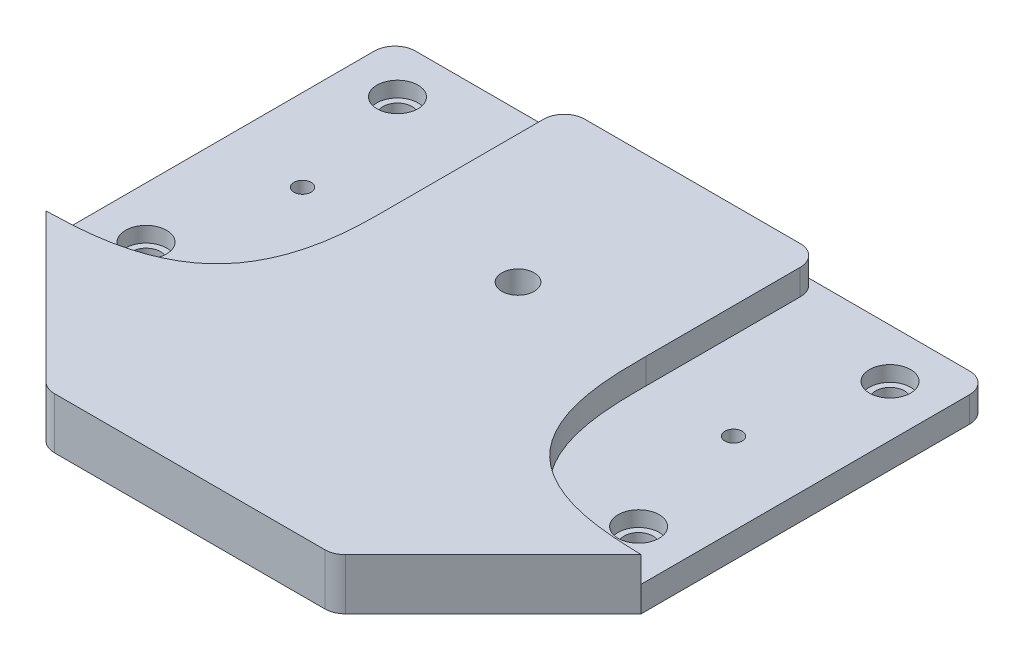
ISO-10303-21;
HEADER;
FILE_DESCRIPTION(('STEP AP214'),'2;1');
FILE_NAME('part.step','',(''),(''),'','','');
FILE_SCHEMA(('AUTOMOTIVE_DESIGN { 1 0 10303 214 1 1 1 1 }'));
ENDSEC;
DATA;
#1=APPLICATION_CONTEXT('core data for automotive mechanical design processes');
#2=APPLICATION_PROTOCOL_DEFINITION('international standard','automotive_design',2000,#1);
#3=PRODUCT_CONTEXT('',#1,'mechanical');
#4=PRODUCT('Part','Part','',(#3));
#5=PRODUCT_RELATED_PRODUCT_CATEGORY('part','',(#4));
#6=PRODUCT_DEFINITION_FORMATION('','',#4);
#7=PRODUCT_DEFINITION_CONTEXT('part definition',#1,'design');
#8=PRODUCT_DEFINITION('design','',#6,#7);
#9=PRODUCT_DEFINITION_SHAPE('','',#8);
#10=(LENGTH_UNIT() NAMED_UNIT(*) SI_UNIT(.MILLI.,.METRE.));
#11=(NAMED_UNIT(*) PLANE_ANGLE_UNIT() SI_UNIT($,.RADIAN.));
#12=(NAMED_UNIT(*) SI_UNIT($,.STERADIAN.) SOLID_ANGLE_UNIT());
#13=UNCERTAINTY_MEASURE_WITH_UNIT(LENGTH_MEASURE(1.E-05),#10,'distance_accuracy_value','');
#14=(GEOMETRIC_REPRESENTATION_CONTEXT(3) GLOBAL_UNCERTAINTY_ASSIGNED_CONTEXT((#13)) GLOBAL_UNIT_ASSIGNED_CONTEXT((#10,
#11,#12)) REPRESENTATION_CONTEXT('',''));
#15=CARTESIAN_POINT('',(0.,0.,0.));
#16=DIRECTION('',(0.,0.,1.));
#17=DIRECTION('',(1.,0.,0.));
#18=AXIS2_PLACEMENT_3D('',#15,#16,#17);
#19=CARTESIAN_POINT('',(73.66,0.,-43.18));
#20=DIRECTION('',(0.,1.,0.));
#21=DIRECTION('',(0.,0.,1.));
#22=AXIS2_PLACEMENT_3D('',#19,#20,#21);
#23=CYLINDRICAL_SURFACE('',#22,4.00050000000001);
#24=CARTESIAN_POINT('',(73.66,12.7,-43.18));
#25=DIRECTION('',(0.,1.,0.));
#26=DIRECTION('',(0.,0.,1.));
#27=AXIS2_PLACEMENT_3D('',#24,#25,#26);
#28=CIRCLE('',#27,4.00050000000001);
#29=CARTESIAN_POINT('',(73.66,12.7,-39.1795));
#30=VERTEX_POINT('',#29);
#31=EDGE_CURVE('E426',#30,#30,#28,.T.);
#32=ORIENTED_EDGE('',*,*,#31,.T.);
#33=EDGE_LOOP('',(#32));
#34=FACE_BOUND('',#33,.T.);
#35=CARTESIAN_POINT('',(73.66,5.08,-43.18));
#36=DIRECTION('',(0.,-1.,0.));
#37=DIRECTION('',(0.,0.,-1.));
#38=AXIS2_PLACEMENT_3D('',#35,#36,#37);
#39=CIRCLE('',#38,4.00050000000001);
#40=CARTESIAN_POINT('',(73.66,5.08,-47.1805));
#41=VERTEX_POINT('',#40);
#42=EDGE_CURVE('E427',#41,#41,#39,.F.);
#43=ORIENTED_EDGE('',*,*,#42,.F.);
#44=EDGE_LOOP('',(#43));
#45=FACE_BOUND('',#44,.T.);
#46=ADVANCED_FACE('F41',(#34,#45),#23,.F.);
#47=CARTESIAN_POINT('',(12.7,6.35,-12.065));
#48=DIRECTION('',(0.,-1.,0.));
#49=DIRECTION('',(0.,0.,-1.));
#50=AXIS2_PLACEMENT_3D('',#47,#48,#49);
#51=CYLINDRICAL_SURFACE('',#50,3.556);
#52=CARTESIAN_POINT('',(12.7,0.,-12.065));
#53=DIRECTION('',(0.,1.,0.));
#54=DIRECTION('',(0.,0.,1.));
#55=AXIS2_PLACEMENT_3D('',#52,#53,#54);
#56=CIRCLE('',#55,3.556);
#57=CARTESIAN_POINT('',(12.7,0.,-8.50900000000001));
#58=VERTEX_POINT('',#57);
#59=EDGE_CURVE('E564',#58,#58,#56,.T.);
#60=ORIENTED_EDGE('',*,*,#59,.F.);
#61=EDGE_LOOP('',(#60));
#62=FACE_BOUND('',#61,.T.);
#63=CARTESIAN_POINT('',(12.7,2.54,-12.065));
#64=DIRECTION('',(0.,1.,0.));
#65=DIRECTION('',(0.,0.,1.));
#66=AXIS2_PLACEMENT_3D('',#63,#64,#65);
#67=CIRCLE('',#66,3.556);
#68=CARTESIAN_POINT('',(12.7,2.54,-8.50900000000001));
#69=VERTEX_POINT('',#68);
#70=EDGE_CURVE('E424',#69,#69,#67,.T.);
#71=ORIENTED_EDGE('',*,*,#70,.T.);
#72=EDGE_LOOP('',(#71));
#73=FACE_BOUND('',#72,.T.);
#74=ADVANCED_FACE('F492',(#62,#73),#51,.F.);
#75=CARTESIAN_POINT('',(12.7,6.35,-74.295));
#76=DIRECTION('',(0.,-1.,0.));
#77=DIRECTION('',(0.,0.,-1.));
#78=AXIS2_PLACEMENT_3D('',#75,#76,#77);
#79=CYLINDRICAL_SURFACE('',#78,3.556);
#80=CARTESIAN_POINT('',(12.7,0.,-74.295));
#81=DIRECTION('',(0.,1.,0.));
#82=DIRECTION('',(0.,0.,1.));
#83=AXIS2_PLACEMENT_3D('',#80,#81,#82);
#84=CIRCLE('',#83,3.556);
#85=CARTESIAN_POINT('',(12.7,0.,-70.739));
#86=VERTEX_POINT('',#85);
#87=EDGE_CURVE('E567',#86,#86,#84,.T.);
#88=ORIENTED_EDGE('',*,*,#87,.F.);
#89=EDGE_LOOP('',(#88));
#90=FACE_BOUND('',#89,.T.);
#91=CARTESIAN_POINT('',(12.7,2.54,-74.295));
#92=DIRECTION('',(0.,1.,0.));
#93=DIRECTION('',(0.,0.,1.));
#94=AXIS2_PLACEMENT_3D('',#91,#92,#93);
#95=CIRCLE('',#94,3.556);
#96=CARTESIAN_POINT('',(12.7,2.54,-70.739));
#97=VERTEX_POINT('',#96);
#98=EDGE_CURVE('E421',#97,#97,#95,.T.);
#99=ORIENTED_EDGE('',*,*,#98,.T.);
#100=EDGE_LOOP('',(#99));
#101=FACE_BOUND('',#100,.T.);
#102=ADVANCED_FACE('F927',(#90,#101),#79,.F.);
#103=CARTESIAN_POINT('',(134.62,6.35,-74.295));
#104=DIRECTION('',(0.,-1.,0.));
#105=DIRECTION('',(0.,0.,-1.));
#106=AXIS2_PLACEMENT_3D('',#103,#104,#105);
#107=CYLINDRICAL_SURFACE('',#106,3.55600000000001);
#108=CARTESIAN_POINT('',(134.62,0.,-74.295));
#109=DIRECTION('',(0.,1.,0.));
#110=DIRECTION('',(0.,0.,1.));
#111=AXIS2_PLACEMENT_3D('',#108,#109,#110);
#112=CIRCLE('',#111,3.55600000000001);
#113=CARTESIAN_POINT('',(134.62,0.,-70.739));
#114=VERTEX_POINT('',#113);
#115=EDGE_CURVE('E570',#114,#114,#112,.T.);
#116=ORIENTED_EDGE('',*,*,#115,.F.);
#117=EDGE_LOOP('',(#116));
#118=FACE_BOUND('',#117,.T.);
#119=CARTESIAN_POINT('',(134.62,2.54,-74.295));
#120=DIRECTION('',(0.,1.,0.));
#121=DIRECTION('',(0.,0.,1.));
#122=AXIS2_PLACEMENT_3D('',#119,#120,#121);
#123=CIRCLE('',#122,3.55600000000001);
#124=CARTESIAN_POINT('',(134.62,2.54,-70.739));
#125=VERTEX_POINT('',#124);
#126=EDGE_CURVE('E417',#125,#125,#123,.T.);
#127=ORIENTED_EDGE('',*,*,#126,.T.);
#128=EDGE_LOOP('',(#127));
#129=FACE_BOUND('',#128,.T.);
#130=ADVANCED_FACE('F651',(#118,#129),#107,.F.);
#131=CARTESIAN_POINT('',(134.62,6.35,-12.065));
#132=DIRECTION('',(0.,-1.,0.));
#133=DIRECTION('',(0.,0.,-1.));
#134=AXIS2_PLACEMENT_3D('',#131,#132,#133);
#135=CYLINDRICAL_SURFACE('',#134,3.55600000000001);
#136=CARTESIAN_POINT('',(134.62,0.,-12.065));
#137=DIRECTION('',(0.,1.,0.));
#138=DIRECTION('',(0.,0.,1.));
#139=AXIS2_PLACEMENT_3D('',#136,#137,#138);
#140=CIRCLE('',#139,3.55600000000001);
#141=CARTESIAN_POINT('',(134.62,0.,-8.50899999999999));
#142=VERTEX_POINT('',#141);
#143=EDGE_CURVE('E573',#142,#142,#140,.T.);
#144=ORIENTED_EDGE('',*,*,#143,.F.);
#145=EDGE_LOOP('',(#144));
#146=FACE_BOUND('',#145,.T.);
#147=CARTESIAN_POINT('',(134.62,2.54,-12.065));
#148=DIRECTION('',(0.,1.,0.));
#149=DIRECTION('',(0.,0.,1.));
#150=AXIS2_PLACEMENT_3D('',#147,#148,#149);
#151=CIRCLE('',#150,3.55600000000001);
#152=CARTESIAN_POINT('',(134.62,2.54,-8.50899999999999));
#153=VERTEX_POINT('',#152);
#154=EDGE_CURVE('E414',#153,#153,#151,.T.);
#155=ORIENTED_EDGE('',*,*,#154,.T.);
#156=EDGE_LOOP('',(#155));
#157=FACE_BOUND('',#156,.T.);
#158=ADVANCED_FACE('F646',(#146,#157),#135,.F.);
#159=CARTESIAN_POINT('',(0.,6.35,0.));
#160=DIRECTION('',(0.,1.,0.));
#161=DIRECTION('',(0.,0.,1.));
#162=AXIS2_PLACEMENT_3D('',#159,#160,#161);
#163=PLANE('',#162);
#164=CARTESIAN_POINT('',(134.62,6.35,-74.295));
#165=DIRECTION('',(0.,1.,0.));
#166=DIRECTION('',(0.,0.,1.));
#167=AXIS2_PLACEMENT_3D('',#164,#165,#166);
#168=CIRCLE('',#167,5.07999999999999);
#169=CARTESIAN_POINT('',(134.62,6.35,-69.215));
#170=VERTEX_POINT('',#169);
#171=EDGE_CURVE('E442',#170,#170,#168,.T.);
#172=ORIENTED_EDGE('',*,*,#171,.F.);
#173=EDGE_LOOP('',(#172));
#174=FACE_BOUND('',#173,.T.);
#175=CARTESIAN_POINT('',(134.62,6.35,-12.065));
#176=DIRECTION('',(0.,1.,0.));
#177=DIRECTION('',(0.,0.,1.));
#178=AXIS2_PLACEMENT_3D('',#175,#176,#177);
#179=CIRCLE('',#178,5.07999999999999);
#180=CARTESIAN_POINT('',(134.62,6.35,-6.98500000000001));
#181=VERTEX_POINT('',#180);
#182=EDGE_CURVE('E429',#181,#181,#179,.T.);
#183=ORIENTED_EDGE('',*,*,#182,.F.);
#184=EDGE_LOOP('',(#183));
#185=FACE_BOUND('',#184,.T.);
#186=DIRECTION('',(0.,0.,-1.));
#187=VECTOR('',#186,1.);
#188=CARTESIAN_POINT('',(147.32,6.35,0.));
#189=LINE('',#188,#187);
#190=CARTESIAN_POINT('',(147.32,6.35,0.));
#191=VERTEX_POINT('',#190);
#192=CARTESIAN_POINT('',(147.32,6.35,-81.28));
#193=VERTEX_POINT('',#192);
#194=EDGE_CURVE('E542',#191,#193,#189,.T.);
#195=ORIENTED_EDGE('',*,*,#194,.T.);
#196=CARTESIAN_POINT('',(142.24,6.35,-81.28));
#197=DIRECTION('',(0.,1.,0.));
#198=DIRECTION('',(0.,0.,1.));
#199=AXIS2_PLACEMENT_3D('',#196,#197,#198);
#200=CIRCLE('',#199,5.08);
#201=CARTESIAN_POINT('',(142.24,6.35,-86.36));
#202=VERTEX_POINT('',#201);
#203=EDGE_CURVE('E399',#193,#202,#200,.T.);
#204=ORIENTED_EDGE('',*,*,#203,.T.);
#205=DIRECTION('',(-1.,0.,0.));
#206=VECTOR('',#205,1.);
#207=CARTESIAN_POINT('',(0.,6.35,-86.36));
#208=LINE('',#207,#206);
#209=CARTESIAN_POINT('',(100.33,6.35,-86.36));
#210=VERTEX_POINT('',#209);
#211=EDGE_CURVE('E548',#202,#210,#208,.T.);
#212=ORIENTED_EDGE('',*,*,#211,.T.);
#213=CARTESIAN_POINT('',(100.33,6.35,-81.28));
#214=DIRECTION('',(0.,1.,0.));
#215=DIRECTION('',(0.,0.,1.));
#216=AXIS2_PLACEMENT_3D('',#213,#214,#215);
#217=CIRCLE('',#216,5.08);
#218=CARTESIAN_POINT('',(105.41,6.35,-81.28));
#219=VERTEX_POINT('',#218);
#220=EDGE_CURVE('E49',#210,#219,#217,.F.);
#221=ORIENTED_EDGE('',*,*,#220,.T.);
#222=DIRECTION('',(0.,0.,-1.));
#223=VECTOR('',#222,1.);
#224=CARTESIAN_POINT('',(105.41,6.35,0.));
#225=LINE('',#224,#223);
#226=CARTESIAN_POINT('',(105.41,6.35,-43.1613194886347));
#227=VERTEX_POINT('',#226);
#228=EDGE_CURVE('E462',#227,#219,#225,.T.);
#229=ORIENTED_EDGE('',*,*,#228,.F.);
#230=CARTESIAN_POINT('',(147.32,6.35,0.));
#231=CARTESIAN_POINT('',(140.237616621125,6.35,-0.208395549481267));
#232=CARTESIAN_POINT('',(133.155233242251,6.35,-0.416791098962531));
#233=CARTESIAN_POINT('',(117.611370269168,6.35,-3.82839865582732));
#234=CARTESIAN_POINT('',(108.362959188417,6.35,-13.3529423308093));
#235=CARTESIAN_POINT('',(105.41,6.35,-28.9904221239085));
#236=CARTESIAN_POINT('',(105.41,6.35,-36.0758708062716));
#237=CARTESIAN_POINT('',(105.41,6.35,-43.1613194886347));
#238=B_SPLINE_CURVE_WITH_KNOTS('',5,(#230,#231,#232,#233,#234,#235,#236,#237),.UNSPECIFIED.,.F.,
.F.,(6,2,6),(0.,0.5,1.),.UNSPECIFIED.);
#239=EDGE_CURVE('E349',#227,#191,#238,.F.);
#240=ORIENTED_EDGE('',*,*,#239,.T.);
#241=EDGE_LOOP('',(#195,#204,#212,#221,#229,#240));
#242=FACE_BOUND('',#241,.T.);
#243=CARTESIAN_POINT('',(127.,6.35,-43.18));
#244=DIRECTION('',(0.,1.,0.));
#245=DIRECTION('',(0.,0.,1.));
#246=AXIS2_PLACEMENT_3D('',#243,#244,#245);
#247=CIRCLE('',#246,2.12725);
#248=CARTESIAN_POINT('',(127.,6.35,-41.05275));
#249=VERTEX_POINT('',#248);
#250=EDGE_CURVE('E199',#249,#249,#247,.T.);
#251=ORIENTED_EDGE('',*,*,#250,.F.);
#252=EDGE_LOOP('',(#251));
#253=FACE_BOUND('',#252,.T.);
#254=ADVANCED_FACE('F503',(#174,#185,#242,#253),#163,.T.);
#255=CARTESIAN_POINT('',(0.,6.35,38.1));
#256=DIRECTION('',(0.,0.,-1.));
#257=DIRECTION('',(-1.,0.,0.));
#258=AXIS2_PLACEMENT_3D('',#255,#256,#257);
#259=PLANE('',#258);
#260=DIRECTION('',(1.,0.,0.));
#261=VECTOR('',#260,1.);
#262=CARTESIAN_POINT('',(0.,0.,38.1));
#263=LINE('',#262,#261);
#264=CARTESIAN_POINT('',(40.2042048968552,0.,38.1));
#265=VERTEX_POINT('',#264);
#266=CARTESIAN_POINT('',(107.115795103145,0.,38.1));
#267=VERTEX_POINT('',#266);
#268=EDGE_CURVE('E561',#265,#267,#263,.T.);
#269=ORIENTED_EDGE('',*,*,#268,.T.);
#270=DIRECTION('',(0.,-1.,0.));
#271=VECTOR('',#270,1.);
#272=CARTESIAN_POINT('',(107.115795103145,6.35,38.1));
#273=LINE('',#272,#271);
#274=CARTESIAN_POINT('',(107.115795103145,12.7,38.1));
#275=VERTEX_POINT('',#274);
#276=EDGE_CURVE('E407',#267,#275,#273,.F.);
#277=ORIENTED_EDGE('',*,*,#276,.T.);
#278=DIRECTION('',(1.,0.,0.));
#279=VECTOR('',#278,1.);
#280=CARTESIAN_POINT('',(109.22,12.7,38.1));
#281=LINE('',#280,#279);
#282=CARTESIAN_POINT('',(40.2042048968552,12.7,38.1));
#283=VERTEX_POINT('',#282);
#284=EDGE_CURVE('E190',#283,#275,#281,.T.);
#285=ORIENTED_EDGE('',*,*,#284,.F.);
#286=DIRECTION('',(0.,-1.,0.));
#287=VECTOR('',#286,1.);
#288=CARTESIAN_POINT('',(40.2042048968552,6.35,38.1));
#289=LINE('',#288,#287);
#290=EDGE_CURVE('E404',#283,#265,#289,.T.);
#291=ORIENTED_EDGE('',*,*,#290,.T.);
#292=EDGE_LOOP('',(#269,#277,#285,#291));
#293=FACE_BOUND('',#292,.T.);
#294=ADVANCED_FACE('F291',(#293),#259,.F.);
#295=CARTESIAN_POINT('',(73.6600000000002,6.35,73.66));
#296=DIRECTION('',(-0.707106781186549,0.,-0.707106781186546));
#297=DIRECTION('',(-0.707106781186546,0.,0.707106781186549));
#298=AXIS2_PLACEMENT_3D('',#295,#296,#297);
#299=PLANE('',#298);
#300=DIRECTION('',(0.707106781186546,0.,-0.707106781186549));
#301=VECTOR('',#300,1.);
#302=CARTESIAN_POINT('',(147.32,12.7,0.));
#303=LINE('',#302,#301);
#304=CARTESIAN_POINT('',(110.707897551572,12.7,36.6121024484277));
#305=VERTEX_POINT('',#304);
#306=CARTESIAN_POINT('',(147.32,12.7,0.));
#307=VERTEX_POINT('',#306);
#308=EDGE_CURVE('E383',#305,#307,#303,.T.);
#309=ORIENTED_EDGE('',*,*,#308,.F.);
#310=DIRECTION('',(0.,-1.,0.));
#311=VECTOR('',#310,1.);
#312=CARTESIAN_POINT('',(110.707897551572,6.35,36.6121024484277));
#313=LINE('',#312,#311);
#314=CARTESIAN_POINT('',(110.707897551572,0.,36.6121024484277));
#315=VERTEX_POINT('',#314);
#316=EDGE_CURVE('E401',#305,#315,#313,.T.);
#317=ORIENTED_EDGE('',*,*,#316,.T.);
#318=DIRECTION('',(0.707106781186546,0.,-0.707106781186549));
#319=VECTOR('',#318,1.);
#320=CARTESIAN_POINT('',(73.6600000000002,0.,73.66));
#321=LINE('',#320,#319);
#322=CARTESIAN_POINT('',(147.32,0.,0.));
#323=VERTEX_POINT('',#322);
#324=EDGE_CURVE('E559',#315,#323,#321,.T.);
#325=ORIENTED_EDGE('',*,*,#324,.T.);
#326=DIRECTION('',(0.,-1.,0.));
#327=VECTOR('',#326,1.);
#328=CARTESIAN_POINT('',(147.32,6.35,0.));
#329=LINE('',#328,#327);
#330=EDGE_CURVE('E522',#191,#323,#329,.T.);
#331=ORIENTED_EDGE('',*,*,#330,.F.);
#332=CARTESIAN_POINT('',(147.32,13.0175,0.));
#333=CARTESIAN_POINT('',(147.32,10.6891666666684,0.));
#334=CARTESIAN_POINT('',(147.32,8.36083333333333,0.));
#335=CARTESIAN_POINT('',(147.32,6.0325,0.));
#336=B_SPLINE_CURVE_WITH_KNOTS('',3,(#332,#333,#334,#335),.UNSPECIFIED.,.F.,.F.,(4,4),
(-0.0066675,0.0003175),.UNSPECIFIED.);
#337=EDGE_CURVE('E200',#307,#191,#336,.T.);
#338=ORIENTED_EDGE('',*,*,#337,.F.);
#339=EDGE_LOOP('',(#309,#317,#325,#331,#338));
#340=FACE_BOUND('',#339,.T.);
#341=ADVANCED_FACE('F287',(#340),#299,.F.);
#342=CARTESIAN_POINT('',(147.32,6.35,0.));
#343=DIRECTION('',(-1.,0.,0.));
#344=DIRECTION('',(0.,0.,1.));
#345=AXIS2_PLACEMENT_3D('',#342,#343,#344);
#346=PLANE('',#345);
#347=DIRECTION('',(0.,0.,-1.));
#348=VECTOR('',#347,1.);
#349=CARTESIAN_POINT('',(147.32,0.,0.));
#350=LINE('',#349,#348);
#351=CARTESIAN_POINT('',(147.32,0.,-81.28));
#352=VERTEX_POINT('',#351);
#353=EDGE_CURVE('E557',#323,#352,#350,.T.);
#354=ORIENTED_EDGE('',*,*,#353,.T.);
#355=DIRECTION('',(0.,-1.,0.));
#356=VECTOR('',#355,1.);
#357=CARTESIAN_POINT('',(147.32,6.35,-81.28));
#358=LINE('',#357,#356);
#359=EDGE_CURVE('E56',#352,#193,#358,.F.);
#360=ORIENTED_EDGE('',*,*,#359,.T.);
#361=ORIENTED_EDGE('',*,*,#194,.F.);
#362=ORIENTED_EDGE('',*,*,#330,.T.);
#363=EDGE_LOOP('',(#354,#360,#361,#362));
#364=FACE_BOUND('',#363,.T.);
#365=ADVANCED_FACE('F283',(#364),#346,.F.);
#366=CARTESIAN_POINT('',(0.,6.35,-86.36));
#367=DIRECTION('',(0.,0.,1.));
#368=DIRECTION('',(1.,0.,0.));
#369=AXIS2_PLACEMENT_3D('',#366,#367,#368);
#370=PLANE('',#369);
#371=DIRECTION('',(-1.,0.,0.));
#372=VECTOR('',#371,1.);
#373=CARTESIAN_POINT('',(0.,0.,-86.36));
#374=LINE('',#373,#372);
#375=CARTESIAN_POINT('',(142.24,0.,-86.36));
#376=VERTEX_POINT('',#375);
#377=CARTESIAN_POINT('',(5.07999999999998,0.,-86.36));
#378=VERTEX_POINT('',#377);
#379=EDGE_CURVE('E552',#376,#378,#374,.T.);
#380=ORIENTED_EDGE('',*,*,#379,.T.);
#381=DIRECTION('',(0.,-1.,0.));
#382=VECTOR('',#381,1.);
#383=CARTESIAN_POINT('',(5.07999999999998,6.35,-86.36));
#384=LINE('',#383,#382);
#385=CARTESIAN_POINT('',(5.07999999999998,6.35,-86.36));
#386=VERTEX_POINT('',#385);
#387=EDGE_CURVE('E593',#378,#386,#384,.F.);
#388=ORIENTED_EDGE('',*,*,#387,.T.);
#389=CARTESIAN_POINT('',(46.99,6.35,-86.36));
#390=VERTEX_POINT('',#389);
#391=EDGE_CURVE('E543',#390,#386,#208,.T.);
#392=ORIENTED_EDGE('',*,*,#391,.F.);
#393=DIRECTION('',(0.,-1.,0.));
#394=VECTOR('',#393,1.);
#395=CARTESIAN_POINT('',(46.99,6.35,-86.36));
#396=LINE('',#395,#394);
#397=CARTESIAN_POINT('',(46.99,12.7,-86.36));
#398=VERTEX_POINT('',#397);
#399=EDGE_CURVE('E626',#390,#398,#396,.F.);
#400=ORIENTED_EDGE('',*,*,#399,.T.);
#401=DIRECTION('',(-1.,0.,0.));
#402=VECTOR('',#401,1.);
#403=CARTESIAN_POINT('',(41.91,12.7,-86.36));
#404=LINE('',#403,#402);
#405=CARTESIAN_POINT('',(100.33,12.7,-86.36));
#406=VERTEX_POINT('',#405);
#407=EDGE_CURVE('E465',#406,#398,#404,.T.);
#408=ORIENTED_EDGE('',*,*,#407,.F.);
#409=DIRECTION('',(0.,-1.,0.));
#410=VECTOR('',#409,1.);
#411=CARTESIAN_POINT('',(100.33,6.35,-86.36));
#412=LINE('',#411,#410);
#413=EDGE_CURVE('E623',#406,#210,#412,.T.);
#414=ORIENTED_EDGE('',*,*,#413,.T.);
#415=ORIENTED_EDGE('',*,*,#211,.F.);
#416=DIRECTION('',(0.,-1.,0.));
#417=VECTOR('',#416,1.);
#418=CARTESIAN_POINT('',(142.24,6.35,-86.36));
#419=LINE('',#418,#417);
#420=EDGE_CURVE('E617',#202,#376,#419,.T.);
#421=ORIENTED_EDGE('',*,*,#420,.T.);
#422=EDGE_LOOP('',(#380,#388,#392,#400,#408,#414,#415,#421));
#423=FACE_BOUND('',#422,.T.);
#424=ADVANCED_FACE('F279',(#423),#370,.F.);
#425=CARTESIAN_POINT('',(0.,6.35,0.));
#426=DIRECTION('',(1.,0.,0.));
#427=DIRECTION('',(0.,0.,-1.));
#428=AXIS2_PLACEMENT_3D('',#425,#426,#427);
#429=PLANE('',#428);
#430=DIRECTION('',(0.,0.,1.));
#431=VECTOR('',#430,1.);
#432=CARTESIAN_POINT('',(0.,6.35,0.));
#433=LINE('',#432,#431);
#434=CARTESIAN_POINT('',(0.,6.35,-81.28));
#435=VERTEX_POINT('',#434);
#436=CARTESIAN_POINT('',(0.,6.35,0.));
#437=VERTEX_POINT('',#436);
#438=EDGE_CURVE('E261',#435,#437,#433,.T.);
#439=ORIENTED_EDGE('',*,*,#438,.F.);
#440=DIRECTION('',(0.,-1.,0.));
#441=VECTOR('',#440,1.);
#442=CARTESIAN_POINT('',(0.,6.35,-81.28));
#443=LINE('',#442,#441);
#444=CARTESIAN_POINT('',(0.,0.,-81.28));
#445=VERTEX_POINT('',#444);
#446=EDGE_CURVE('E177',#435,#445,#443,.T.);
#447=ORIENTED_EDGE('',*,*,#446,.T.);
#448=DIRECTION('',(0.,0.,1.));
#449=VECTOR('',#448,1.);
#450=CARTESIAN_POINT('',(0.,0.,0.));
#451=LINE('',#450,#449);
#452=CARTESIAN_POINT('',(0.,0.,0.));
#453=VERTEX_POINT('',#452);
#454=EDGE_CURVE('E550',#445,#453,#451,.T.);
#455=ORIENTED_EDGE('',*,*,#454,.T.);
#456=DIRECTION('',(0.,-1.,0.));
#457=VECTOR('',#456,1.);
#458=CARTESIAN_POINT('',(0.,6.35,0.));
#459=LINE('',#458,#457);
#460=EDGE_CURVE('E520',#437,#453,#459,.T.);
#461=ORIENTED_EDGE('',*,*,#460,.F.);
#462=EDGE_LOOP('',(#439,#447,#455,#461));
#463=FACE_BOUND('',#462,.T.);
#464=ADVANCED_FACE('F274',(#463),#429,.F.);
#465=CARTESIAN_POINT('',(0.,6.35,0.));
#466=DIRECTION('',(0.707106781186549,0.,-0.707106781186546));
#467=DIRECTION('',(-0.707106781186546,0.,-0.707106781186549));
#468=AXIS2_PLACEMENT_3D('',#465,#466,#467);
#469=PLANE('',#468);
#470=DIRECTION('',(0.707106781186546,0.,0.707106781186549));
#471=VECTOR('',#470,1.);
#472=CARTESIAN_POINT('',(0.,0.,0.));
#473=LINE('',#472,#471);
#474=CARTESIAN_POINT('',(36.6121024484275,0.,36.6121024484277));
#475=VERTEX_POINT('',#474);
#476=EDGE_CURVE('E544',#453,#475,#473,.T.);
#477=ORIENTED_EDGE('',*,*,#476,.T.);
#478=DIRECTION('',(0.,-1.,0.));
#479=VECTOR('',#478,1.);
#480=CARTESIAN_POINT('',(36.6121024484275,6.35,36.6121024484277));
#481=LINE('',#480,#479);
#482=CARTESIAN_POINT('',(36.6121024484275,12.7,36.6121024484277));
#483=VERTEX_POINT('',#482);
#484=EDGE_CURVE('E189',#475,#483,#481,.F.);
#485=ORIENTED_EDGE('',*,*,#484,.T.);
#486=DIRECTION('',(0.707106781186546,0.,0.707106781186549));
#487=VECTOR('',#486,1.);
#488=CARTESIAN_POINT('',(38.0999999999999,12.7,38.1));
#489=LINE('',#488,#487);
#490=CARTESIAN_POINT('',(0.,12.7,0.));
#491=VERTEX_POINT('',#490);
#492=EDGE_CURVE('E168',#491,#483,#489,.T.);
#493=ORIENTED_EDGE('',*,*,#492,.F.);
#494=CARTESIAN_POINT('',(0.,6.0325,0.));
#495=CARTESIAN_POINT('',(0.,8.36083333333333,0.));
#496=CARTESIAN_POINT('',(0.,10.6891666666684,0.));
#497=CARTESIAN_POINT('',(0.,13.0175,0.));
#498=B_SPLINE_CURVE_WITH_KNOTS('',3,(#494,#495,#496,#497),.UNSPECIFIED.,.F.,.F.,(4,4),
(-0.0066675,0.0003175),.UNSPECIFIED.);
#499=EDGE_CURVE('E186',#491,#437,#498,.F.);
#500=ORIENTED_EDGE('',*,*,#499,.T.);
#501=ORIENTED_EDGE('',*,*,#460,.T.);
#502=EDGE_LOOP('',(#477,#485,#493,#500,#501));
#503=FACE_BOUND('',#502,.T.);
#504=ADVANCED_FACE('F184',(#503),#469,.F.);
#505=CARTESIAN_POINT('',(12.7,6.35,-12.065));
#506=DIRECTION('',(0.,1.,0.));
#507=DIRECTION('',(0.,0.,1.));
#508=AXIS2_PLACEMENT_3D('',#505,#506,#507);
#509=CIRCLE('',#508,5.08);
#510=CARTESIAN_POINT('',(12.7,6.35,-6.985));
#511=VERTEX_POINT('',#510);
#512=EDGE_CURVE('E448',#511,#511,#509,.T.);
#513=ORIENTED_EDGE('',*,*,#512,.F.);
#514=EDGE_LOOP('',(#513));
#515=FACE_BOUND('',#514,.T.);
#516=CARTESIAN_POINT('',(12.7,6.35,-74.295));
#517=DIRECTION('',(0.,1.,0.));
#518=DIRECTION('',(0.,0.,1.));
#519=AXIS2_PLACEMENT_3D('',#516,#517,#518);
#520=CIRCLE('',#519,5.08);
#521=CARTESIAN_POINT('',(12.7,6.35,-69.215));
#522=VERTEX_POINT('',#521);
#523=EDGE_CURVE('E447',#522,#522,#520,.T.);
#524=ORIENTED_EDGE('',*,*,#523,.F.);
#525=EDGE_LOOP('',(#524));
#526=FACE_BOUND('',#525,.T.);
#527=ORIENTED_EDGE('',*,*,#391,.T.);
#528=CARTESIAN_POINT('',(5.07999999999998,6.35,-81.28));
#529=DIRECTION('',(0.,1.,0.));
#530=DIRECTION('',(0.,0.,1.));
#531=AXIS2_PLACEMENT_3D('',#528,#529,#530);
#532=CIRCLE('',#531,5.08);
#533=EDGE_CURVE('E595',#386,#435,#532,.T.);
#534=ORIENTED_EDGE('',*,*,#533,.T.);
#535=ORIENTED_EDGE('',*,*,#438,.T.);
#536=CARTESIAN_POINT('',(41.91,6.35,-43.1613194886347));
#537=CARTESIAN_POINT('',(41.91,6.35,-36.0758708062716));
#538=CARTESIAN_POINT('',(41.91,6.35,-28.9904221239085));
#539=CARTESIAN_POINT('',(38.9570408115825,6.35,-13.3529423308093));
#540=CARTESIAN_POINT('',(29.7086297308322,6.35,-3.82839865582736));
#541=CARTESIAN_POINT('',(14.164766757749,6.35,-0.416791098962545));
#542=CARTESIAN_POINT('',(7.08238337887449,6.35,-0.208395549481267));
#543=CARTESIAN_POINT('',(0.,6.35,0.));
#544=B_SPLINE_CURVE_WITH_KNOTS('',5,(#536,#537,#538,#539,#540,#541,#542,#543),.UNSPECIFIED.,.F.,
.F.,(6,2,6),(0.,0.5,1.),.UNSPECIFIED.);
#545=CARTESIAN_POINT('',(41.91,6.35,-43.1613194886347));
#546=VERTEX_POINT('',#545);
#547=EDGE_CURVE('E196',#437,#546,#544,.F.);
#548=ORIENTED_EDGE('',*,*,#547,.T.);
#549=DIRECTION('',(0.,0.,1.));
#550=VECTOR('',#549,1.);
#551=CARTESIAN_POINT('',(41.91,6.35,0.));
#552=LINE('',#551,#550);
#553=CARTESIAN_POINT('',(41.91,6.35,-81.28));
#554=VERTEX_POINT('',#553);
#555=EDGE_CURVE('E472',#554,#546,#552,.T.);
#556=ORIENTED_EDGE('',*,*,#555,.F.);
#557=CARTESIAN_POINT('',(46.99,6.35,-81.28));
#558=DIRECTION('',(0.,1.,0.));
#559=DIRECTION('',(0.,0.,1.));
#560=AXIS2_PLACEMENT_3D('',#557,#558,#559);
#561=CIRCLE('',#560,5.08);
#562=EDGE_CURVE('E410',#554,#390,#561,.F.);
#563=ORIENTED_EDGE('',*,*,#562,.T.);
#564=EDGE_LOOP('',(#527,#534,#535,#548,#556,#563));
#565=FACE_BOUND('',#564,.T.);
#566=CARTESIAN_POINT('',(20.32,6.35,-43.18));
#567=DIRECTION('',(0.,1.,0.));
#568=DIRECTION('',(0.,0.,1.));
#569=AXIS2_PLACEMENT_3D('',#566,#567,#568);
#570=CIRCLE('',#569,2.12725);
#571=CARTESIAN_POINT('',(20.32,6.35,-41.05275));
#572=VERTEX_POINT('',#571);
#573=EDGE_CURVE('E582',#572,#572,#570,.T.);
#574=ORIENTED_EDGE('',*,*,#573,.F.);
#575=EDGE_LOOP('',(#574));
#576=FACE_BOUND('',#575,.T.);
#577=ADVANCED_FACE('F273',(#515,#526,#565,#576),#163,.T.);
#578=CARTESIAN_POINT('',(0.,0.,0.));
#579=DIRECTION('',(0.,1.,0.));
#580=DIRECTION('',(0.,0.,1.));
#581=AXIS2_PLACEMENT_3D('',#578,#579,#580);
#582=PLANE('',#581);
#583=CARTESIAN_POINT('',(73.66,0.,-43.18));
#584=DIRECTION('',(0.,-1.,0.));
#585=DIRECTION('',(0.,0.,-1.));
#586=AXIS2_PLACEMENT_3D('',#583,#584,#585);
#587=CIRCLE('',#586,22.225);
#588=CARTESIAN_POINT('',(73.66,0.,-65.405));
#589=VERTEX_POINT('',#588);
#590=EDGE_CURVE('E430',#589,#589,#587,.T.);
#591=ORIENTED_EDGE('',*,*,#590,.F.);
#592=EDGE_LOOP('',(#591));
#593=FACE_BOUND('',#592,.T.);
#594=CARTESIAN_POINT('',(20.32,0.,-43.18));
#595=DIRECTION('',(0.,1.,0.));
#596=DIRECTION('',(0.,0.,1.));
#597=AXIS2_PLACEMENT_3D('',#594,#595,#596);
#598=CIRCLE('',#597,2.12725);
#599=CARTESIAN_POINT('',(20.32,0.,-41.05275));
#600=VERTEX_POINT('',#599);
#601=EDGE_CURVE('E575',#600,#600,#598,.T.);
#602=ORIENTED_EDGE('',*,*,#601,.T.);
#603=EDGE_LOOP('',(#602));
#604=FACE_BOUND('',#603,.T.);
#605=CARTESIAN_POINT('',(127.,0.,-43.18));
#606=DIRECTION('',(0.,1.,0.));
#607=DIRECTION('',(0.,0.,1.));
#608=AXIS2_PLACEMENT_3D('',#605,#606,#607);
#609=CIRCLE('',#608,2.12725);
#610=CARTESIAN_POINT('',(127.,0.,-41.05275));
#611=VERTEX_POINT('',#610);
#612=EDGE_CURVE('E579',#611,#611,#609,.T.);
#613=ORIENTED_EDGE('',*,*,#612,.T.);
#614=EDGE_LOOP('',(#613));
#615=FACE_BOUND('',#614,.T.);
#616=ORIENTED_EDGE('',*,*,#143,.T.);
#617=EDGE_LOOP('',(#616));
#618=FACE_BOUND('',#617,.T.);
#619=ORIENTED_EDGE('',*,*,#115,.T.);
#620=EDGE_LOOP('',(#619));
#621=FACE_BOUND('',#620,.T.);
#622=ORIENTED_EDGE('',*,*,#87,.T.);
#623=EDGE_LOOP('',(#622));
#624=FACE_BOUND('',#623,.T.);
#625=ORIENTED_EDGE('',*,*,#59,.T.);
#626=EDGE_LOOP('',(#625));
#627=FACE_BOUND('',#626,.T.);
#628=ORIENTED_EDGE('',*,*,#454,.F.);
#629=CARTESIAN_POINT('',(5.07999999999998,0.,-81.28));
#630=DIRECTION('',(0.,1.,0.));
#631=DIRECTION('',(0.,0.,1.));
#632=AXIS2_PLACEMENT_3D('',#629,#630,#631);
#633=CIRCLE('',#632,5.08);
#634=EDGE_CURVE('E628',#445,#378,#633,.F.);
#635=ORIENTED_EDGE('',*,*,#634,.T.);
#636=ORIENTED_EDGE('',*,*,#379,.F.);
#637=CARTESIAN_POINT('',(142.24,0.,-81.28));
#638=DIRECTION('',(0.,1.,0.));
#639=DIRECTION('',(0.,0.,1.));
#640=AXIS2_PLACEMENT_3D('',#637,#638,#639);
#641=CIRCLE('',#640,5.08);
#642=EDGE_CURVE('E612',#376,#352,#641,.F.);
#643=ORIENTED_EDGE('',*,*,#642,.T.);
#644=ORIENTED_EDGE('',*,*,#353,.F.);
#645=ORIENTED_EDGE('',*,*,#324,.F.);
#646=CARTESIAN_POINT('',(107.115795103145,0.,33.02));
#647=DIRECTION('',(0.,1.,0.));
#648=DIRECTION('',(0.,0.,1.));
#649=AXIS2_PLACEMENT_3D('',#646,#647,#648);
#650=CIRCLE('',#649,5.08);
#651=EDGE_CURVE('E606',#315,#267,#650,.F.);
#652=ORIENTED_EDGE('',*,*,#651,.T.);
#653=ORIENTED_EDGE('',*,*,#268,.F.);
#654=CARTESIAN_POINT('',(40.2042048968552,0.,33.02));
#655=DIRECTION('',(0.,1.,0.));
#656=DIRECTION('',(0.,0.,1.));
#657=AXIS2_PLACEMENT_3D('',#654,#655,#656);
#658=CIRCLE('',#657,5.08);
#659=EDGE_CURVE('E634',#265,#475,#658,.F.);
#660=ORIENTED_EDGE('',*,*,#659,.T.);
#661=ORIENTED_EDGE('',*,*,#476,.F.);
#662=EDGE_LOOP('',(#628,#635,#636,#643,#644,#645,#652,#653,#660,#661));
#663=FACE_BOUND('',#662,.T.);
#664=ADVANCED_FACE('F275',(#593,#604,#615,#618,#621,#624,#627,#663),#582,.F.);
#665=CARTESIAN_POINT('',(127.,0.,-43.18));
#666=DIRECTION('',(0.,1.,0.));
#667=DIRECTION('',(0.,0.,1.));
#668=AXIS2_PLACEMENT_3D('',#665,#666,#667);
#669=CYLINDRICAL_SURFACE('',#668,2.12725);
#670=ORIENTED_EDGE('',*,*,#612,.F.);
#671=EDGE_LOOP('',(#670));
#672=FACE_BOUND('',#671,.T.);
#673=ORIENTED_EDGE('',*,*,#250,.T.);
#674=EDGE_LOOP('',(#673));
#675=FACE_BOUND('',#674,.T.);
#676=ADVANCED_FACE('F496',(#672,#675),#669,.F.);
#677=CARTESIAN_POINT('',(20.32,0.,-43.18));
#678=DIRECTION('',(0.,1.,0.));
#679=DIRECTION('',(0.,0.,1.));
#680=AXIS2_PLACEMENT_3D('',#677,#678,#679);
#681=CYLINDRICAL_SURFACE('',#680,2.12725);
#682=ORIENTED_EDGE('',*,*,#601,.F.);
#683=EDGE_LOOP('',(#682));
#684=FACE_BOUND('',#683,.T.);
#685=ORIENTED_EDGE('',*,*,#573,.T.);
#686=EDGE_LOOP('',(#685));
#687=FACE_BOUND('',#686,.T.);
#688=ADVANCED_FACE('F364',(#684,#687),#681,.F.);
#689=CARTESIAN_POINT('',(0.,12.7,0.));
#690=DIRECTION('',(0.,-1.,0.));
#691=DIRECTION('',(0.,0.,-1.));
#692=AXIS2_PLACEMENT_3D('',#689,#690,#691);
#693=PLANE('',#692);
#694=ORIENTED_EDGE('',*,*,#407,.T.);
#695=CARTESIAN_POINT('',(46.99,12.7,-81.28));
#696=DIRECTION('',(0.,-1.,0.));
#697=DIRECTION('',(0.,0.,-1.));
#698=AXIS2_PLACEMENT_3D('',#695,#696,#697);
#699=CIRCLE('',#698,5.08);
#700=CARTESIAN_POINT('',(41.91,12.7,-81.28));
#701=VERTEX_POINT('',#700);
#702=EDGE_CURVE('E394',#398,#701,#699,.F.);
#703=ORIENTED_EDGE('',*,*,#702,.T.);
#704=DIRECTION('',(0.,0.,1.));
#705=VECTOR('',#704,1.);
#706=CARTESIAN_POINT('',(41.91,12.7,0.));
#707=LINE('',#706,#705);
#708=CARTESIAN_POINT('',(41.91,12.7,-43.1613194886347));
#709=VERTEX_POINT('',#708);
#710=EDGE_CURVE('E171',#701,#709,#707,.T.);
#711=ORIENTED_EDGE('',*,*,#710,.T.);
#712=CARTESIAN_POINT('',(0.,12.7,0.));
#713=CARTESIAN_POINT('',(7.08238337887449,12.7,-0.208395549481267));
#714=CARTESIAN_POINT('',(14.164766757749,12.7,-0.416791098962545));
#715=CARTESIAN_POINT('',(29.7086297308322,12.7,-3.82839865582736));
#716=CARTESIAN_POINT('',(38.9570408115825,12.7,-13.3529423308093));
#717=CARTESIAN_POINT('',(41.91,12.7,-28.9904221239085));
#718=CARTESIAN_POINT('',(41.91,12.7,-36.0758708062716));
#719=CARTESIAN_POINT('',(41.91,12.7,-43.1613194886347));
#720=B_SPLINE_CURVE_WITH_KNOTS('',5,(#712,#713,#714,#715,#716,#717,#718,#719),.UNSPECIFIED.,.F.,
.F.,(6,2,6),(0.,0.5,1.),.UNSPECIFIED.);
#721=EDGE_CURVE('E162',#709,#491,#720,.F.);
#722=ORIENTED_EDGE('',*,*,#721,.T.);
#723=ORIENTED_EDGE('',*,*,#492,.T.);
#724=CARTESIAN_POINT('',(40.2042048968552,12.7,33.02));
#725=DIRECTION('',(0.,-1.,0.));
#726=DIRECTION('',(0.,0.,-1.));
#727=AXIS2_PLACEMENT_3D('',#724,#725,#726);
#728=CIRCLE('',#727,5.08);
#729=EDGE_CURVE('E388',#483,#283,#728,.F.);
#730=ORIENTED_EDGE('',*,*,#729,.T.);
#731=ORIENTED_EDGE('',*,*,#284,.T.);
#732=CARTESIAN_POINT('',(107.115795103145,12.7,33.02));
#733=DIRECTION('',(0.,-1.,0.));
#734=DIRECTION('',(0.,0.,-1.));
#735=AXIS2_PLACEMENT_3D('',#732,#733,#734);
#736=CIRCLE('',#735,5.08);
#737=EDGE_CURVE('E390',#275,#305,#736,.F.);
#738=ORIENTED_EDGE('',*,*,#737,.T.);
#739=ORIENTED_EDGE('',*,*,#308,.T.);
#740=CARTESIAN_POINT('',(105.41,12.7,-43.1613194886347));
#741=CARTESIAN_POINT('',(105.41,12.7,-36.0758708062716));
#742=CARTESIAN_POINT('',(105.41,12.7,-28.9904221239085));
#743=CARTESIAN_POINT('',(108.362959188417,12.7,-13.3529423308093));
#744=CARTESIAN_POINT('',(117.611370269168,12.7,-3.82839865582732));
#745=CARTESIAN_POINT('',(133.155233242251,12.7,-0.416791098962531));
#746=CARTESIAN_POINT('',(140.237616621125,12.7,-0.208395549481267));
#747=CARTESIAN_POINT('',(147.32,12.7,0.));
#748=B_SPLINE_CURVE_WITH_KNOTS('',5,(#740,#741,#742,#743,#744,#745,#746,#747),.UNSPECIFIED.,.F.,
.F.,(6,2,6),(0.,0.5,1.),.UNSPECIFIED.);
#749=CARTESIAN_POINT('',(105.41,12.7,-43.1613194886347));
#750=VERTEX_POINT('',#749);
#751=EDGE_CURVE('E178',#307,#750,#748,.F.);
#752=ORIENTED_EDGE('',*,*,#751,.T.);
#753=DIRECTION('',(0.,0.,-1.));
#754=VECTOR('',#753,1.);
#755=CARTESIAN_POINT('',(105.41,12.7,0.));
#756=LINE('',#755,#754);
#757=CARTESIAN_POINT('',(105.41,12.7,-81.28));
#758=VERTEX_POINT('',#757);
#759=EDGE_CURVE('E468',#750,#758,#756,.T.);
#760=ORIENTED_EDGE('',*,*,#759,.T.);
#761=CARTESIAN_POINT('',(100.33,12.7,-81.28));
#762=DIRECTION('',(0.,-1.,0.));
#763=DIRECTION('',(0.,0.,-1.));
#764=AXIS2_PLACEMENT_3D('',#761,#762,#763);
#765=CIRCLE('',#764,5.08);
#766=EDGE_CURVE('E392',#758,#406,#765,.F.);
#767=ORIENTED_EDGE('',*,*,#766,.T.);
#768=EDGE_LOOP('',(#694,#703,#711,#722,#723,#730,#731,#738,#739,#752,#760,#767));
#769=FACE_BOUND('',#768,.T.);
#770=ORIENTED_EDGE('',*,*,#31,.F.);
#771=EDGE_LOOP('',(#770));
#772=FACE_BOUND('',#771,.T.);
#773=ADVANCED_FACE('F166',(#769,#772),#693,.F.);
#774=CARTESIAN_POINT('',(105.41,12.7,0.));
#775=DIRECTION('',(-1.,0.,0.));
#776=DIRECTION('',(0.,0.,1.));
#777=AXIS2_PLACEMENT_3D('',#774,#775,#776);
#778=PLANE('',#777);
#779=ORIENTED_EDGE('',*,*,#228,.T.);
#780=DIRECTION('',(0.,-1.,0.));
#781=VECTOR('',#780,1.);
#782=CARTESIAN_POINT('',(105.41,12.7,-81.28));
#783=LINE('',#782,#781);
#784=EDGE_CURVE('E396',#219,#758,#783,.F.);
#785=ORIENTED_EDGE('',*,*,#784,.T.);
#786=ORIENTED_EDGE('',*,*,#759,.F.);
#787=CARTESIAN_POINT('',(105.41,6.0325,-43.1613194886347));
#788=CARTESIAN_POINT('',(105.41,8.36083333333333,-43.1613194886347));
#789=CARTESIAN_POINT('',(105.41,10.6891666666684,-43.1613194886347));
#790=CARTESIAN_POINT('',(105.41,13.0175,-43.1613194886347));
#791=B_SPLINE_CURVE_WITH_KNOTS('',3,(#787,#788,#789,#790),.UNSPECIFIED.,.F.,.F.,(4,4),
(-0.0066675,0.0003175),.UNSPECIFIED.);
#792=EDGE_CURVE('E339',#750,#227,#791,.F.);
#793=ORIENTED_EDGE('',*,*,#792,.T.);
#794=EDGE_LOOP('',(#779,#785,#786,#793));
#795=FACE_BOUND('',#794,.T.);
#796=ADVANCED_FACE('F363',(#795),#778,.F.);
#797=CARTESIAN_POINT('',(41.91,12.7,0.));
#798=DIRECTION('',(1.,0.,0.));
#799=DIRECTION('',(0.,0.,-1.));
#800=AXIS2_PLACEMENT_3D('',#797,#798,#799);
#801=PLANE('',#800);
#802=ORIENTED_EDGE('',*,*,#710,.F.);
#803=DIRECTION('',(0.,-1.,0.));
#804=VECTOR('',#803,1.);
#805=CARTESIAN_POINT('',(41.91,12.7,-81.28));
#806=LINE('',#805,#804);
#807=EDGE_CURVE('E386',#701,#554,#806,.T.);
#808=ORIENTED_EDGE('',*,*,#807,.T.);
#809=ORIENTED_EDGE('',*,*,#555,.T.);
#810=CARTESIAN_POINT('',(41.91,13.0175,-43.1613194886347));
#811=CARTESIAN_POINT('',(41.91,10.6891666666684,-43.1613194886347));
#812=CARTESIAN_POINT('',(41.91,8.36083333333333,-43.1613194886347));
#813=CARTESIAN_POINT('',(41.91,6.0325,-43.1613194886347));
#814=B_SPLINE_CURVE_WITH_KNOTS('',3,(#810,#811,#812,#813),.UNSPECIFIED.,.F.,.F.,(4,4),
(-0.0066675,0.0003175),.UNSPECIFIED.);
#815=EDGE_CURVE('E248',#546,#709,#814,.F.);
#816=ORIENTED_EDGE('',*,*,#815,.T.);
#817=EDGE_LOOP('',(#802,#808,#809,#816));
#818=FACE_BOUND('',#817,.T.);
#819=ADVANCED_FACE('F367',(#818),#801,.F.);
#820=CARTESIAN_POINT('',(147.32,6.0325,0.));
#821=CARTESIAN_POINT('',(147.32,8.36083333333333,0.));
#822=CARTESIAN_POINT('',(147.32,10.6891666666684,0.));
#823=CARTESIAN_POINT('',(147.32,13.0175,0.));
#824=CARTESIAN_POINT('',(140.237616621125,6.0325,-0.208395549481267));
#825=CARTESIAN_POINT('',(140.237616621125,8.36083333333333,-0.208395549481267));
#826=CARTESIAN_POINT('',(140.237616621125,10.6891666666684,-0.208395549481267));
#827=CARTESIAN_POINT('',(140.237616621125,13.0175,-0.208395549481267));
#828=CARTESIAN_POINT('',(133.155233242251,6.0325,-0.416791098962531));
#829=CARTESIAN_POINT('',(133.155233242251,8.36083333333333,-0.416791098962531));
#830=CARTESIAN_POINT('',(133.155233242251,10.6891666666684,-0.416791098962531));
#831=CARTESIAN_POINT('',(133.155233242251,13.0175,-0.416791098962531));
#832=CARTESIAN_POINT('',(117.611370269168,6.0325,-3.82839865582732));
#833=CARTESIAN_POINT('',(117.611370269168,8.36083333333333,-3.82839865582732));
#834=CARTESIAN_POINT('',(117.611370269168,10.6891666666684,-3.82839865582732));
#835=CARTESIAN_POINT('',(117.611370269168,13.0175,-3.82839865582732));
#836=CARTESIAN_POINT('',(108.362959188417,6.0325,-13.3529423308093));
#837=CARTESIAN_POINT('',(108.362959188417,8.36083333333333,-13.3529423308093));
#838=CARTESIAN_POINT('',(108.362959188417,10.6891666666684,-13.3529423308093));
#839=CARTESIAN_POINT('',(108.362959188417,13.0175,-13.3529423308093));
#840=CARTESIAN_POINT('',(105.41,6.0325,-28.9904221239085));
#841=CARTESIAN_POINT('',(105.41,8.36083333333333,-28.9904221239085));
#842=CARTESIAN_POINT('',(105.41,10.6891666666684,-28.9904221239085));
#843=CARTESIAN_POINT('',(105.41,13.0175,-28.9904221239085));
#844=CARTESIAN_POINT('',(105.41,6.0325,-36.0758708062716));
#845=CARTESIAN_POINT('',(105.41,8.36083333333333,-36.0758708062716));
#846=CARTESIAN_POINT('',(105.41,10.6891666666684,-36.0758708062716));
#847=CARTESIAN_POINT('',(105.41,13.0175,-36.0758708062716));
#848=CARTESIAN_POINT('',(105.41,6.0325,-43.1613194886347));
#849=CARTESIAN_POINT('',(105.41,8.36083333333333,-43.1613194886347));
#850=CARTESIAN_POINT('',(105.41,10.6891666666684,-43.1613194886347));
#851=CARTESIAN_POINT('',(105.41,13.0175,-43.1613194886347));
#852=B_SPLINE_SURFACE_WITH_KNOTS('',5,3,((#820,#821,#822,#823),(#824,#825,#826,#827),(#828,#829,
#830,#831),(#832,#833,#834,#835),(#836,#837,#838,#839),(#840,#841,#842,#843),(#844,#845,#846,
#847),(#848,#849,#850,#851)),.UNSPECIFIED.,.F.,.F.,.F.,(6,2,6),(4,4),(0.,0.5,1.),(-0.0066675,
0.0003175),.UNSPECIFIED.);
#853=ORIENTED_EDGE('',*,*,#751,.F.);
#854=ORIENTED_EDGE('',*,*,#337,.T.);
#855=ORIENTED_EDGE('',*,*,#239,.F.);
#856=ORIENTED_EDGE('',*,*,#792,.F.);
#857=EDGE_LOOP('',(#853,#854,#855,#856));
#858=FACE_BOUND('',#857,.T.);
#859=ADVANCED_FACE('F225',(#858),#852,.T.);
#860=CARTESIAN_POINT('',(41.91,6.0325,-43.1613194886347));
#861=CARTESIAN_POINT('',(41.91,8.36083333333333,-43.1613194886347));
#862=CARTESIAN_POINT('',(41.91,10.6891666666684,-43.1613194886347));
#863=CARTESIAN_POINT('',(41.91,13.0175,-43.1613194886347));
#864=CARTESIAN_POINT('',(41.91,6.0325,-36.0758708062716));
#865=CARTESIAN_POINT('',(41.91,8.36083333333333,-36.0758708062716));
#866=CARTESIAN_POINT('',(41.91,10.6891666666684,-36.0758708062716));
#867=CARTESIAN_POINT('',(41.91,13.0175,-36.0758708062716));
#868=CARTESIAN_POINT('',(41.91,6.0325,-28.9904221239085));
#869=CARTESIAN_POINT('',(41.91,8.36083333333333,-28.9904221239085));
#870=CARTESIAN_POINT('',(41.91,10.6891666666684,-28.9904221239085));
#871=CARTESIAN_POINT('',(41.91,13.0175,-28.9904221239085));
#872=CARTESIAN_POINT('',(38.9570408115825,6.0325,-13.3529423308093));
#873=CARTESIAN_POINT('',(38.9570408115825,8.36083333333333,-13.3529423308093));
#874=CARTESIAN_POINT('',(38.9570408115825,10.6891666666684,-13.3529423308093));
#875=CARTESIAN_POINT('',(38.9570408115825,13.0175,-13.3529423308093));
#876=CARTESIAN_POINT('',(29.7086297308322,6.0325,-3.82839865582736));
#877=CARTESIAN_POINT('',(29.7086297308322,8.36083333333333,-3.82839865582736));
#878=CARTESIAN_POINT('',(29.7086297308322,10.6891666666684,-3.82839865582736));
#879=CARTESIAN_POINT('',(29.7086297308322,13.0175,-3.82839865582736));
#880=CARTESIAN_POINT('',(14.164766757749,6.0325,-0.416791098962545));
#881=CARTESIAN_POINT('',(14.164766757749,8.36083333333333,-0.416791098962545));
#882=CARTESIAN_POINT('',(14.164766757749,10.6891666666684,-0.416791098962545));
#883=CARTESIAN_POINT('',(14.164766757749,13.0175,-0.416791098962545));
#884=CARTESIAN_POINT('',(7.08238337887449,6.0325,-0.208395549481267));
#885=CARTESIAN_POINT('',(7.08238337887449,8.36083333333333,-0.208395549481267));
#886=CARTESIAN_POINT('',(7.08238337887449,10.6891666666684,-0.208395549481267));
#887=CARTESIAN_POINT('',(7.08238337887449,13.0175,-0.208395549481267));
#888=CARTESIAN_POINT('',(0.,6.0325,0.));
#889=CARTESIAN_POINT('',(0.,8.36083333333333,0.));
#890=CARTESIAN_POINT('',(0.,10.6891666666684,0.));
#891=CARTESIAN_POINT('',(0.,13.0175,0.));
#892=B_SPLINE_SURFACE_WITH_KNOTS('',5,3,((#860,#861,#862,#863),(#864,#865,#866,#867),(#868,#869,
#870,#871),(#872,#873,#874,#875),(#876,#877,#878,#879),(#880,#881,#882,#883),(#884,#885,#886,
#887),(#888,#889,#890,#891)),.UNSPECIFIED.,.F.,.F.,.F.,(6,2,6),(4,4),(0.,0.5,1.),(-0.0066675,
0.0003175),.UNSPECIFIED.);
#893=ORIENTED_EDGE('',*,*,#721,.F.);
#894=ORIENTED_EDGE('',*,*,#815,.F.);
#895=ORIENTED_EDGE('',*,*,#547,.F.);
#896=ORIENTED_EDGE('',*,*,#499,.F.);
#897=EDGE_LOOP('',(#893,#894,#895,#896));
#898=FACE_BOUND('',#897,.T.);
#899=ADVANCED_FACE('F194',(#898),#892,.T.);
#900=CARTESIAN_POINT('',(5.07999999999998,6.35,-81.28));
#901=DIRECTION('',(0.,-1.,0.));
#902=DIRECTION('',(0.,0.,-1.));
#903=AXIS2_PLACEMENT_3D('',#900,#901,#902);
#904=CYLINDRICAL_SURFACE('',#903,5.08);
#905=ORIENTED_EDGE('',*,*,#533,.F.);
#906=ORIENTED_EDGE('',*,*,#387,.F.);
#907=ORIENTED_EDGE('',*,*,#634,.F.);
#908=ORIENTED_EDGE('',*,*,#446,.F.);
#909=EDGE_LOOP('',(#905,#906,#907,#908));
#910=FACE_BOUND('',#909,.T.);
#911=ADVANCED_FACE('F224',(#910),#904,.T.);
#912=CARTESIAN_POINT('',(46.99,12.7,-81.28));
#913=DIRECTION('',(0.,-1.,0.));
#914=DIRECTION('',(0.,0.,-1.));
#915=AXIS2_PLACEMENT_3D('',#912,#913,#914);
#916=CYLINDRICAL_SURFACE('',#915,5.08);
#917=ORIENTED_EDGE('',*,*,#702,.F.);
#918=ORIENTED_EDGE('',*,*,#399,.F.);
#919=ORIENTED_EDGE('',*,*,#562,.F.);
#920=ORIENTED_EDGE('',*,*,#807,.F.);
#921=EDGE_LOOP('',(#917,#918,#919,#920));
#922=FACE_BOUND('',#921,.T.);
#923=ADVANCED_FACE('F705',(#922),#916,.T.);
#924=CARTESIAN_POINT('',(100.33,6.35,-81.28));
#925=DIRECTION('',(0.,-1.,0.));
#926=DIRECTION('',(0.,0.,-1.));
#927=AXIS2_PLACEMENT_3D('',#924,#925,#926);
#928=CYLINDRICAL_SURFACE('',#927,5.08);
#929=ORIENTED_EDGE('',*,*,#766,.F.);
#930=ORIENTED_EDGE('',*,*,#784,.F.);
#931=ORIENTED_EDGE('',*,*,#220,.F.);
#932=ORIENTED_EDGE('',*,*,#413,.F.);
#933=EDGE_LOOP('',(#929,#930,#931,#932));
#934=FACE_BOUND('',#933,.T.);
#935=ADVANCED_FACE('F709',(#934),#928,.T.);
#936=CARTESIAN_POINT('',(142.24,6.35,-81.28));
#937=DIRECTION('',(0.,-1.,0.));
#938=DIRECTION('',(0.,0.,-1.));
#939=AXIS2_PLACEMENT_3D('',#936,#937,#938);
#940=CYLINDRICAL_SURFACE('',#939,5.08);
#941=ORIENTED_EDGE('',*,*,#203,.F.);
#942=ORIENTED_EDGE('',*,*,#359,.F.);
#943=ORIENTED_EDGE('',*,*,#642,.F.);
#944=ORIENTED_EDGE('',*,*,#420,.F.);
#945=EDGE_LOOP('',(#941,#942,#943,#944));
#946=FACE_BOUND('',#945,.T.);
#947=ADVANCED_FACE('F614',(#946),#940,.T.);
#948=CARTESIAN_POINT('',(107.115795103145,6.35,33.02));
#949=DIRECTION('',(0.,-1.,0.));
#950=DIRECTION('',(0.,0.,-1.));
#951=AXIS2_PLACEMENT_3D('',#948,#949,#950);
#952=CYLINDRICAL_SURFACE('',#951,5.08);
#953=ORIENTED_EDGE('',*,*,#737,.F.);
#954=ORIENTED_EDGE('',*,*,#276,.F.);
#955=ORIENTED_EDGE('',*,*,#651,.F.);
#956=ORIENTED_EDGE('',*,*,#316,.F.);
#957=EDGE_LOOP('',(#953,#954,#955,#956));
#958=FACE_BOUND('',#957,.T.);
#959=ADVANCED_FACE('F605',(#958),#952,.T.);
#960=CARTESIAN_POINT('',(40.2042048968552,6.35,33.02));
#961=DIRECTION('',(0.,-1.,0.));
#962=DIRECTION('',(0.,0.,-1.));
#963=AXIS2_PLACEMENT_3D('',#960,#961,#962);
#964=CYLINDRICAL_SURFACE('',#963,5.08);
#965=ORIENTED_EDGE('',*,*,#729,.F.);
#966=ORIENTED_EDGE('',*,*,#484,.F.);
#967=ORIENTED_EDGE('',*,*,#659,.F.);
#968=ORIENTED_EDGE('',*,*,#290,.F.);
#969=EDGE_LOOP('',(#965,#966,#967,#968));
#970=FACE_BOUND('',#969,.T.);
#971=ADVANCED_FACE('F641',(#970),#964,.T.);
#972=CARTESIAN_POINT('',(12.7,2.54,-74.295));
#973=DIRECTION('',(0.,1.,0.));
#974=DIRECTION('',(0.,0.,1.));
#975=AXIS2_PLACEMENT_3D('',#972,#973,#974);
#976=CYLINDRICAL_SURFACE('',#975,5.08);
#977=CARTESIAN_POINT('',(12.7,2.54,-74.295));
#978=DIRECTION('',(0.,1.,0.));
#979=DIRECTION('',(0.,0.,1.));
#980=AXIS2_PLACEMENT_3D('',#977,#978,#979);
#981=CIRCLE('',#980,5.08);
#982=CARTESIAN_POINT('',(12.7,2.54,-69.215));
#983=VERTEX_POINT('',#982);
#984=EDGE_CURVE('E418',#983,#983,#981,.T.);
#985=CARTESIAN_POINT('',(12.7,2.54,-69.215));
#986=CARTESIAN_POINT('',(12.7,2.5796875,-69.215));
#987=CARTESIAN_POINT('',(12.7,2.619375,-69.215));
#988=CARTESIAN_POINT('',(12.7,2.69875,-69.215));
#989=CARTESIAN_POINT('',(12.7,2.7384375,-69.215));
#990=CARTESIAN_POINT('',(12.7,2.8178125,-69.215));
#991=CARTESIAN_POINT('',(12.7,2.8575,-69.215));
#992=CARTESIAN_POINT('',(12.7,2.936875,-69.215));
#993=CARTESIAN_POINT('',(12.7,2.9765625,-69.215));
#994=CARTESIAN_POINT('',(12.7,3.0559375,-69.215));
#995=CARTESIAN_POINT('',(12.7,3.095625,-69.215));
#996=CARTESIAN_POINT('',(12.7,3.175,-69.215));
#997=CARTESIAN_POINT('',(12.7,3.2146875,-69.215));
#998=CARTESIAN_POINT('',(12.7,3.2940625,-69.215));
#999=CARTESIAN_POINT('',(12.7,3.33375,-69.215));
#1000=CARTESIAN_POINT('',(12.7,3.413125,-69.215));
#1001=CARTESIAN_POINT('',(12.7,3.4528125,-69.215));
#1002=CARTESIAN_POINT('',(12.7,3.5321875,-69.215));
#1003=CARTESIAN_POINT('',(12.7,3.571875,-69.215));
#1004=CARTESIAN_POINT('',(12.7,3.65125,-69.215));
#1005=CARTESIAN_POINT('',(12.7,3.6909375,-69.215));
#1006=CARTESIAN_POINT('',(12.7,3.7703125,-69.215));
#1007=CARTESIAN_POINT('',(12.7,3.81,-69.215));
#1008=CARTESIAN_POINT('',(12.7,3.889375,-69.215));
#1009=CARTESIAN_POINT('',(12.7,3.9290625,-69.215));
#1010=CARTESIAN_POINT('',(12.7,4.0084375,-69.215));
#1011=CARTESIAN_POINT('',(12.7,4.048125,-69.215));
#1012=CARTESIAN_POINT('',(12.7,4.1275,-69.215));
#1013=CARTESIAN_POINT('',(12.7,4.1671875,-69.215));
#1014=CARTESIAN_POINT('',(12.7,4.2465625,-69.215));
#1015=CARTESIAN_POINT('',(12.7,4.28625,-69.215));
#1016=CARTESIAN_POINT('',(12.7,4.365625,-69.215));
#1017=CARTESIAN_POINT('',(12.7,4.4053125,-69.215));
#1018=CARTESIAN_POINT('',(12.7,4.4846875,-69.215));
#1019=CARTESIAN_POINT('',(12.7,4.524375,-69.215));
#1020=CARTESIAN_POINT('',(12.7,4.60375,-69.215));
#1021=CARTESIAN_POINT('',(12.7,4.6434375,-69.215));
#1022=CARTESIAN_POINT('',(12.7,4.7228125,-69.215));
#1023=CARTESIAN_POINT('',(12.7,4.7625,-69.215));
#1024=CARTESIAN_POINT('',(12.7,4.841875,-69.215));
#1025=CARTESIAN_POINT('',(12.7,4.8815625,-69.215));
#1026=CARTESIAN_POINT('',(12.7,4.9609375,-69.215));
#1027=CARTESIAN_POINT('',(12.7,5.000625,-69.215));
#1028=CARTESIAN_POINT('',(12.7,5.08,-69.215));
#1029=CARTESIAN_POINT('',(12.7,5.1196875,-69.215));
#1030=CARTESIAN_POINT('',(12.7,5.1990625,-69.215));
#1031=CARTESIAN_POINT('',(12.7,5.23875,-69.215));
#1032=CARTESIAN_POINT('',(12.7,5.318125,-69.215));
#1033=CARTESIAN_POINT('',(12.7,5.3578125,-69.215));
#1034=CARTESIAN_POINT('',(12.7,5.4371875,-69.215));
#1035=CARTESIAN_POINT('',(12.7,5.476875,-69.215));
#1036=CARTESIAN_POINT('',(12.7,5.55625,-69.215));
#1037=CARTESIAN_POINT('',(12.7,5.5959375,-69.215));
#1038=CARTESIAN_POINT('',(12.7,5.6753125,-69.215));
#1039=CARTESIAN_POINT('',(12.7,5.715,-69.215));
#1040=CARTESIAN_POINT('',(12.7,5.794375,-69.215));
#1041=CARTESIAN_POINT('',(12.7,5.8340625,-69.215));
#1042=CARTESIAN_POINT('',(12.7,5.9134375,-69.215));
#1043=CARTESIAN_POINT('',(12.7,5.953125,-69.215));
#1044=CARTESIAN_POINT('',(12.7,6.0325,-69.215));
#1045=CARTESIAN_POINT('',(12.7,6.0721875,-69.215));
#1046=CARTESIAN_POINT('',(12.7,6.1515625,-69.215));
#1047=CARTESIAN_POINT('',(12.7,6.19125,-69.215));
#1048=CARTESIAN_POINT('',(12.7,6.270625,-69.215));
#1049=CARTESIAN_POINT('',(12.7,6.3103125,-69.215));
#1050=CARTESIAN_POINT('',(12.7,6.35,-69.215));
#1051=B_SPLINE_CURVE_WITH_KNOTS('',3,(#985,#986,#987,#988,#989,#990,#991,#992,#993,#994,#995,
#996,#997,#998,#999,#1000,#1001,#1002,#1003,#1004,#1005,#1006,#1007,#1008,#1009,#1010,#1011,
#1012,#1013,#1014,#1015,#1016,#1017,#1018,#1019,#1020,#1021,#1022,#1023,#1024,#1025,#1026,#1027,
#1028,#1029,#1030,#1031,#1032,#1033,#1034,#1035,#1036,#1037,#1038,#1039,#1040,#1041,#1042,#1043,
#1044,#1045,#1046,#1047,#1048,#1049,#1050),.UNSPECIFIED.,.F.,.F.,(4,2,2,2,2,2,2,2,2,2,2,2,2,2,2,
2,2,2,2,2,2,2,2,2,2,2,2,2,2,2,2,2,4),(0.,0.1190625,0.238125,0.3571875,0.47625,0.5953125,
0.714375,0.8334375,0.9525,1.0715625,1.190625,1.3096875,1.42875,1.5478125,1.666875,1.7859375,
1.905,2.0240625,2.143125,2.2621875,2.38125,2.5003125,2.619375,2.7384375,2.8575,2.9765625,
3.095625,3.2146875,3.33375,3.4528125,3.571875,3.6909375,3.81),.UNSPECIFIED.);
#1052=EDGE_CURVE('BSEAM365',#983,#522,#1051,.T.);
#1053=ORIENTED_EDGE('',*,*,#984,.F.);
#1054=ORIENTED_EDGE('',*,*,#523,.T.);
#1055=ORIENTED_EDGE('',*,*,#1052,.T.);
#1056=ORIENTED_EDGE('',*,*,#1052,.F.);
#1057=EDGE_LOOP('',(#1053,#1055,#1054,#1056));
#1058=FACE_BOUND('',#1057,.T.);
#1059=ADVANCED_FACE('F365',(#1058),#976,.F.);
#1060=CARTESIAN_POINT('',(12.7,2.54,-74.295));
#1061=DIRECTION('',(0.,1.,0.));
#1062=DIRECTION('',(0.,0.,1.));
#1063=AXIS2_PLACEMENT_3D('',#1060,#1061,#1062);
#1064=PLANE('',#1063);
#1065=ORIENTED_EDGE('',*,*,#98,.F.);
#1066=EDGE_LOOP('',(#1065));
#1067=FACE_BOUND('',#1066,.T.);
#1068=ORIENTED_EDGE('',*,*,#984,.T.);
#1069=EDGE_LOOP('',(#1068));
#1070=FACE_BOUND('',#1069,.T.);
#1071=ADVANCED_FACE('F678',(#1067,#1070),#1064,.T.);
#1072=CARTESIAN_POINT('',(12.7,2.54,-12.065));
#1073=DIRECTION('',(0.,1.,0.));
#1074=DIRECTION('',(0.,0.,1.));
#1075=AXIS2_PLACEMENT_3D('',#1072,#1073,#1074);
#1076=CYLINDRICAL_SURFACE('',#1075,5.08);
#1077=CARTESIAN_POINT('',(12.7,2.54,-12.065));
#1078=DIRECTION('',(0.,1.,0.));
#1079=DIRECTION('',(0.,0.,1.));
#1080=AXIS2_PLACEMENT_3D('',#1077,#1078,#1079);
#1081=CIRCLE('',#1080,5.08);
#1082=CARTESIAN_POINT('',(12.7,2.54,-6.985));
#1083=VERTEX_POINT('',#1082);
#1084=EDGE_CURVE('E444',#1083,#1083,#1081,.T.);
#1085=CARTESIAN_POINT('',(12.7,2.54,-6.985));
#1086=CARTESIAN_POINT('',(12.7,2.5796875,-6.985));
#1087=CARTESIAN_POINT('',(12.7,2.619375,-6.985));
#1088=CARTESIAN_POINT('',(12.7,2.69875,-6.985));
#1089=CARTESIAN_POINT('',(12.7,2.7384375,-6.985));
#1090=CARTESIAN_POINT('',(12.7,2.8178125,-6.985));
#1091=CARTESIAN_POINT('',(12.7,2.8575,-6.985));
#1092=CARTESIAN_POINT('',(12.7,2.936875,-6.985));
#1093=CARTESIAN_POINT('',(12.7,2.9765625,-6.985));
#1094=CARTESIAN_POINT('',(12.7,3.0559375,-6.985));
#1095=CARTESIAN_POINT('',(12.7,3.095625,-6.985));
#1096=CARTESIAN_POINT('',(12.7,3.175,-6.985));
#1097=CARTESIAN_POINT('',(12.7,3.2146875,-6.985));
#1098=CARTESIAN_POINT('',(12.7,3.2940625,-6.985));
#1099=CARTESIAN_POINT('',(12.7,3.33375,-6.985));
#1100=CARTESIAN_POINT('',(12.7,3.413125,-6.985));
#1101=CARTESIAN_POINT('',(12.7,3.4528125,-6.985));
#1102=CARTESIAN_POINT('',(12.7,3.5321875,-6.985));
#1103=CARTESIAN_POINT('',(12.7,3.571875,-6.985));
#1104=CARTESIAN_POINT('',(12.7,3.65125,-6.985));
#1105=CARTESIAN_POINT('',(12.7,3.6909375,-6.985));
#1106=CARTESIAN_POINT('',(12.7,3.7703125,-6.985));
#1107=CARTESIAN_POINT('',(12.7,3.81,-6.985));
#1108=CARTESIAN_POINT('',(12.7,3.889375,-6.985));
#1109=CARTESIAN_POINT('',(12.7,3.9290625,-6.985));
#1110=CARTESIAN_POINT('',(12.7,4.0084375,-6.985));
#1111=CARTESIAN_POINT('',(12.7,4.048125,-6.985));
#1112=CARTESIAN_POINT('',(12.7,4.1275,-6.985));
#1113=CARTESIAN_POINT('',(12.7,4.1671875,-6.985));
#1114=CARTESIAN_POINT('',(12.7,4.2465625,-6.985));
#1115=CARTESIAN_POINT('',(12.7,4.28625,-6.985));
#1116=CARTESIAN_POINT('',(12.7,4.365625,-6.985));
#1117=CARTESIAN_POINT('',(12.7,4.4053125,-6.985));
#1118=CARTESIAN_POINT('',(12.7,4.4846875,-6.985));
#1119=CARTESIAN_POINT('',(12.7,4.524375,-6.985));
#1120=CARTESIAN_POINT('',(12.7,4.60375,-6.985));
#1121=CARTESIAN_POINT('',(12.7,4.6434375,-6.985));
#1122=CARTESIAN_POINT('',(12.7,4.7228125,-6.985));
#1123=CARTESIAN_POINT('',(12.7,4.7625,-6.985));
#1124=CARTESIAN_POINT('',(12.7,4.841875,-6.985));
#1125=CARTESIAN_POINT('',(12.7,4.8815625,-6.985));
#1126=CARTESIAN_POINT('',(12.7,4.9609375,-6.985));
#1127=CARTESIAN_POINT('',(12.7,5.000625,-6.985));
#1128=CARTESIAN_POINT('',(12.7,5.08,-6.985));
#1129=CARTESIAN_POINT('',(12.7,5.1196875,-6.985));
#1130=CARTESIAN_POINT('',(12.7,5.1990625,-6.985));
#1131=CARTESIAN_POINT('',(12.7,5.23875,-6.985));
#1132=CARTESIAN_POINT('',(12.7,5.318125,-6.985));
#1133=CARTESIAN_POINT('',(12.7,5.3578125,-6.985));
#1134=CARTESIAN_POINT('',(12.7,5.4371875,-6.985));
#1135=CARTESIAN_POINT('',(12.7,5.476875,-6.985));
#1136=CARTESIAN_POINT('',(12.7,5.55625,-6.985));
#1137=CARTESIAN_POINT('',(12.7,5.5959375,-6.985));
#1138=CARTESIAN_POINT('',(12.7,5.6753125,-6.985));
#1139=CARTESIAN_POINT('',(12.7,5.715,-6.985));
#1140=CARTESIAN_POINT('',(12.7,5.794375,-6.985));
#1141=CARTESIAN_POINT('',(12.7,5.8340625,-6.985));
#1142=CARTESIAN_POINT('',(12.7,5.9134375,-6.985));
#1143=CARTESIAN_POINT('',(12.7,5.953125,-6.985));
#1144=CARTESIAN_POINT('',(12.7,6.0325,-6.985));
#1145=CARTESIAN_POINT('',(12.7,6.0721875,-6.985));
#1146=CARTESIAN_POINT('',(12.7,6.1515625,-6.985));
#1147=CARTESIAN_POINT('',(12.7,6.19125,-6.985));
#1148=CARTESIAN_POINT('',(12.7,6.270625,-6.985));
#1149=CARTESIAN_POINT('',(12.7,6.3103125,-6.985));
#1150=CARTESIAN_POINT('',(12.7,6.35,-6.985));
#1151=B_SPLINE_CURVE_WITH_KNOTS('',3,(#1085,#1086,#1087,#1088,#1089,#1090,#1091,#1092,#1093,
#1094,#1095,#1096,#1097,#1098,#1099,#1100,#1101,#1102,#1103,#1104,#1105,#1106,#1107,#1108,#1109,
#1110,#1111,#1112,#1113,#1114,#1115,#1116,#1117,#1118,#1119,#1120,#1121,#1122,#1123,#1124,#1125,
#1126,#1127,#1128,#1129,#1130,#1131,#1132,#1133,#1134,#1135,#1136,#1137,#1138,#1139,#1140,#1141,
#1142,#1143,#1144,#1145,#1146,#1147,#1148,#1149,#1150),.UNSPECIFIED.,.F.,.F.,(4,2,2,2,2,2,2,2,2,
2,2,2,2,2,2,2,2,2,2,2,2,2,2,2,2,2,2,2,2,2,2,2,4),(0.,0.1190625,0.238125,0.3571875,0.47625,
0.5953125,0.714375,0.8334375,0.9525,1.0715625,1.190625,1.3096875,1.42875,1.5478125,1.666875,
1.7859375,1.905,2.0240625,2.143125,2.2621875,2.38125,2.5003125,2.619375,2.7384375,2.8575,
2.9765625,3.095625,3.2146875,3.33375,3.4528125,3.571875,3.6909375,3.81),.UNSPECIFIED.);
#1152=EDGE_CURVE('BSEAM670',#1083,#511,#1151,.T.);
#1153=ORIENTED_EDGE('',*,*,#1084,.F.);
#1154=ORIENTED_EDGE('',*,*,#512,.T.);
#1155=ORIENTED_EDGE('',*,*,#1152,.T.);
#1156=ORIENTED_EDGE('',*,*,#1152,.F.);
#1157=EDGE_LOOP('',(#1153,#1155,#1154,#1156));
#1158=FACE_BOUND('',#1157,.T.);
#1159=ADVANCED_FACE('F670',(#1158),#1076,.F.);
#1160=CARTESIAN_POINT('',(12.7,2.54,-12.065));
#1161=DIRECTION('',(0.,1.,0.));
#1162=DIRECTION('',(0.,0.,1.));
#1163=AXIS2_PLACEMENT_3D('',#1160,#1161,#1162);
#1164=PLANE('',#1163);
#1165=ORIENTED_EDGE('',*,*,#70,.F.);
#1166=EDGE_LOOP('',(#1165));
#1167=FACE_BOUND('',#1166,.T.);
#1168=ORIENTED_EDGE('',*,*,#1084,.T.);
#1169=EDGE_LOOP('',(#1168));
#1170=FACE_BOUND('',#1169,.T.);
#1171=ADVANCED_FACE('F660',(#1167,#1170),#1164,.T.);
#1172=CARTESIAN_POINT('',(134.62,2.54,-12.065));
#1173=DIRECTION('',(0.,1.,0.));
#1174=DIRECTION('',(0.,0.,1.));
#1175=AXIS2_PLACEMENT_3D('',#1172,#1173,#1174);
#1176=CYLINDRICAL_SURFACE('',#1175,5.07999999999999);
#1177=CARTESIAN_POINT('',(134.62,2.54,-12.065));
#1178=DIRECTION('',(0.,1.,0.));
#1179=DIRECTION('',(0.,0.,1.));
#1180=AXIS2_PLACEMENT_3D('',#1177,#1178,#1179);
#1181=CIRCLE('',#1180,5.07999999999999);
#1182=CARTESIAN_POINT('',(134.62,2.54,-6.98500000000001));
#1183=VERTEX_POINT('',#1182);
#1184=EDGE_CURVE('E434',#1183,#1183,#1181,.T.);
#1185=CARTESIAN_POINT('',(134.62,2.54,-6.98500000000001));
#1186=CARTESIAN_POINT('',(134.62,2.5796875,-6.98500000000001));
#1187=CARTESIAN_POINT('',(134.62,2.619375,-6.98500000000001));
#1188=CARTESIAN_POINT('',(134.62,2.69875,-6.98500000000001));
#1189=CARTESIAN_POINT('',(134.62,2.7384375,-6.98500000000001));
#1190=CARTESIAN_POINT('',(134.62,2.8178125,-6.98500000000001));
#1191=CARTESIAN_POINT('',(134.62,2.8575,-6.98500000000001));
#1192=CARTESIAN_POINT('',(134.62,2.936875,-6.98500000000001));
#1193=CARTESIAN_POINT('',(134.62,2.9765625,-6.98500000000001));
#1194=CARTESIAN_POINT('',(134.62,3.0559375,-6.98500000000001));
#1195=CARTESIAN_POINT('',(134.62,3.095625,-6.98500000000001));
#1196=CARTESIAN_POINT('',(134.62,3.175,-6.98500000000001));
#1197=CARTESIAN_POINT('',(134.62,3.2146875,-6.98500000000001));
#1198=CARTESIAN_POINT('',(134.62,3.2940625,-6.98500000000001));
#1199=CARTESIAN_POINT('',(134.62,3.33375,-6.98500000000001));
#1200=CARTESIAN_POINT('',(134.62,3.413125,-6.98500000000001));
#1201=CARTESIAN_POINT('',(134.62,3.4528125,-6.98500000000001));
#1202=CARTESIAN_POINT('',(134.62,3.5321875,-6.98500000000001));
#1203=CARTESIAN_POINT('',(134.62,3.571875,-6.98500000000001));
#1204=CARTESIAN_POINT('',(134.62,3.65125,-6.98500000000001));
#1205=CARTESIAN_POINT('',(134.62,3.6909375,-6.98500000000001));
#1206=CARTESIAN_POINT('',(134.62,3.7703125,-6.98500000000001));
#1207=CARTESIAN_POINT('',(134.62,3.81,-6.98500000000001));
#1208=CARTESIAN_POINT('',(134.62,3.889375,-6.98500000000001));
#1209=CARTESIAN_POINT('',(134.62,3.9290625,-6.98500000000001));
#1210=CARTESIAN_POINT('',(134.62,4.0084375,-6.98500000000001));
#1211=CARTESIAN_POINT('',(134.62,4.048125,-6.98500000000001));
#1212=CARTESIAN_POINT('',(134.62,4.1275,-6.98500000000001));
#1213=CARTESIAN_POINT('',(134.62,4.1671875,-6.98500000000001));
#1214=CARTESIAN_POINT('',(134.62,4.2465625,-6.98500000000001));
#1215=CARTESIAN_POINT('',(134.62,4.28625,-6.98500000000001));
#1216=CARTESIAN_POINT('',(134.62,4.365625,-6.98500000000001));
#1217=CARTESIAN_POINT('',(134.62,4.4053125,-6.98500000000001));
#1218=CARTESIAN_POINT('',(134.62,4.4846875,-6.98500000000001));
#1219=CARTESIAN_POINT('',(134.62,4.524375,-6.98500000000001));
#1220=CARTESIAN_POINT('',(134.62,4.60375,-6.98500000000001));
#1221=CARTESIAN_POINT('',(134.62,4.6434375,-6.98500000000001));
#1222=CARTESIAN_POINT('',(134.62,4.7228125,-6.98500000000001));
#1223=CARTESIAN_POINT('',(134.62,4.7625,-6.98500000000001));
#1224=CARTESIAN_POINT('',(134.62,4.841875,-6.98500000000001));
#1225=CARTESIAN_POINT('',(134.62,4.8815625,-6.98500000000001));
#1226=CARTESIAN_POINT('',(134.62,4.9609375,-6.98500000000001));
#1227=CARTESIAN_POINT('',(134.62,5.000625,-6.98500000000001));
#1228=CARTESIAN_POINT('',(134.62,5.08,-6.98500000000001));
#1229=CARTESIAN_POINT('',(134.62,5.1196875,-6.98500000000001));
#1230=CARTESIAN_POINT('',(134.62,5.1990625,-6.98500000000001));
#1231=CARTESIAN_POINT('',(134.62,5.23875,-6.98500000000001));
#1232=CARTESIAN_POINT('',(134.62,5.318125,-6.98500000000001));
#1233=CARTESIAN_POINT('',(134.62,5.3578125,-6.98500000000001));
#1234=CARTESIAN_POINT('',(134.62,5.4371875,-6.98500000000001));
#1235=CARTESIAN_POINT('',(134.62,5.476875,-6.98500000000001));
#1236=CARTESIAN_POINT('',(134.62,5.55625,-6.98500000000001));
#1237=CARTESIAN_POINT('',(134.62,5.5959375,-6.98500000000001));
#1238=CARTESIAN_POINT('',(134.62,5.6753125,-6.98500000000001));
#1239=CARTESIAN_POINT('',(134.62,5.715,-6.98500000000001));
#1240=CARTESIAN_POINT('',(134.62,5.794375,-6.98500000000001));
#1241=CARTESIAN_POINT('',(134.62,5.8340625,-6.98500000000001));
#1242=CARTESIAN_POINT('',(134.62,5.9134375,-6.98500000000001));
#1243=CARTESIAN_POINT('',(134.62,5.953125,-6.98500000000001));
#1244=CARTESIAN_POINT('',(134.62,6.0325,-6.98500000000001));
#1245=CARTESIAN_POINT('',(134.62,6.0721875,-6.98500000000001));
#1246=CARTESIAN_POINT('',(134.62,6.1515625,-6.98500000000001));
#1247=CARTESIAN_POINT('',(134.62,6.19125,-6.98500000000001));
#1248=CARTESIAN_POINT('',(134.62,6.270625,-6.98500000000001));
#1249=CARTESIAN_POINT('',(134.62,6.3103125,-6.98500000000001));
#1250=CARTESIAN_POINT('',(134.62,6.35,-6.98500000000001));
#1251=B_SPLINE_CURVE_WITH_KNOTS('',3,(#1185,#1186,#1187,#1188,#1189,#1190,#1191,#1192,#1193,
#1194,#1195,#1196,#1197,#1198,#1199,#1200,#1201,#1202,#1203,#1204,#1205,#1206,#1207,#1208,#1209,
#1210,#1211,#1212,#1213,#1214,#1215,#1216,#1217,#1218,#1219,#1220,#1221,#1222,#1223,#1224,#1225,
#1226,#1227,#1228,#1229,#1230,#1231,#1232,#1233,#1234,#1235,#1236,#1237,#1238,#1239,#1240,#1241,
#1242,#1243,#1244,#1245,#1246,#1247,#1248,#1249,#1250),.UNSPECIFIED.,.F.,.F.,(4,2,2,2,2,2,2,2,2,
2,2,2,2,2,2,2,2,2,2,2,2,2,2,2,2,2,2,2,2,2,2,2,4),(0.,0.1190625,0.238125,0.3571875,0.47625,
0.5953125,0.714375,0.8334375,0.9525,1.0715625,1.190625,1.3096875,1.42875,1.5478125,1.666875,
1.7859375,1.905,2.0240625,2.143125,2.2621875,2.38125,2.5003125,2.619375,2.7384375,2.8575,
2.9765625,3.095625,3.2146875,3.33375,3.4528125,3.571875,3.6909375,3.81),.UNSPECIFIED.);
#1252=EDGE_CURVE('BSEAM657',#1183,#181,#1251,.T.);
#1253=ORIENTED_EDGE('',*,*,#1184,.F.);
#1254=ORIENTED_EDGE('',*,*,#182,.T.);
#1255=ORIENTED_EDGE('',*,*,#1252,.T.);
#1256=ORIENTED_EDGE('',*,*,#1252,.F.);
#1257=EDGE_LOOP('',(#1253,#1255,#1254,#1256));
#1258=FACE_BOUND('',#1257,.T.);
#1259=ADVANCED_FACE('F657',(#1258),#1176,.F.);
#1260=CARTESIAN_POINT('',(134.62,2.54,-12.065));
#1261=DIRECTION('',(0.,1.,0.));
#1262=DIRECTION('',(0.,0.,1.));
#1263=AXIS2_PLACEMENT_3D('',#1260,#1261,#1262);
#1264=PLANE('',#1263);
#1265=ORIENTED_EDGE('',*,*,#154,.F.);
#1266=EDGE_LOOP('',(#1265));
#1267=FACE_BOUND('',#1266,.T.);
#1268=ORIENTED_EDGE('',*,*,#1184,.T.);
#1269=EDGE_LOOP('',(#1268));
#1270=FACE_BOUND('',#1269,.T.);
#1271=ADVANCED_FACE('F659',(#1267,#1270),#1264,.T.);
#1272=CARTESIAN_POINT('',(134.62,2.54,-74.295));
#1273=DIRECTION('',(0.,1.,0.));
#1274=DIRECTION('',(0.,0.,1.));
#1275=AXIS2_PLACEMENT_3D('',#1272,#1273,#1274);
#1276=CYLINDRICAL_SURFACE('',#1275,5.07999999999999);
#1277=CARTESIAN_POINT('',(134.62,2.54,-74.295));
#1278=DIRECTION('',(0.,1.,0.));
#1279=DIRECTION('',(0.,0.,1.));
#1280=AXIS2_PLACEMENT_3D('',#1277,#1278,#1279);
#1281=CIRCLE('',#1280,5.07999999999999);
#1282=CARTESIAN_POINT('',(134.62,2.54,-69.215));
#1283=VERTEX_POINT('',#1282);
#1284=EDGE_CURVE('E451',#1283,#1283,#1281,.T.);
#1285=CARTESIAN_POINT('',(134.62,2.54,-69.215));
#1286=CARTESIAN_POINT('',(134.62,2.5796875,-69.215));
#1287=CARTESIAN_POINT('',(134.62,2.619375,-69.215));
#1288=CARTESIAN_POINT('',(134.62,2.69875,-69.215));
#1289=CARTESIAN_POINT('',(134.62,2.7384375,-69.215));
#1290=CARTESIAN_POINT('',(134.62,2.8178125,-69.215));
#1291=CARTESIAN_POINT('',(134.62,2.8575,-69.215));
#1292=CARTESIAN_POINT('',(134.62,2.936875,-69.215));
#1293=CARTESIAN_POINT('',(134.62,2.9765625,-69.215));
#1294=CARTESIAN_POINT('',(134.62,3.0559375,-69.215));
#1295=CARTESIAN_POINT('',(134.62,3.095625,-69.215));
#1296=CARTESIAN_POINT('',(134.62,3.175,-69.215));
#1297=CARTESIAN_POINT('',(134.62,3.2146875,-69.215));
#1298=CARTESIAN_POINT('',(134.62,3.2940625,-69.215));
#1299=CARTESIAN_POINT('',(134.62,3.33375,-69.215));
#1300=CARTESIAN_POINT('',(134.62,3.413125,-69.215));
#1301=CARTESIAN_POINT('',(134.62,3.4528125,-69.215));
#1302=CARTESIAN_POINT('',(134.62,3.5321875,-69.215));
#1303=CARTESIAN_POINT('',(134.62,3.571875,-69.215));
#1304=CARTESIAN_POINT('',(134.62,3.65125,-69.215));
#1305=CARTESIAN_POINT('',(134.62,3.6909375,-69.215));
#1306=CARTESIAN_POINT('',(134.62,3.7703125,-69.215));
#1307=CARTESIAN_POINT('',(134.62,3.81,-69.215));
#1308=CARTESIAN_POINT('',(134.62,3.889375,-69.215));
#1309=CARTESIAN_POINT('',(134.62,3.9290625,-69.215));
#1310=CARTESIAN_POINT('',(134.62,4.0084375,-69.215));
#1311=CARTESIAN_POINT('',(134.62,4.048125,-69.215));
#1312=CARTESIAN_POINT('',(134.62,4.1275,-69.215));
#1313=CARTESIAN_POINT('',(134.62,4.1671875,-69.215));
#1314=CARTESIAN_POINT('',(134.62,4.2465625,-69.215));
#1315=CARTESIAN_POINT('',(134.62,4.28625,-69.215));
#1316=CARTESIAN_POINT('',(134.62,4.365625,-69.215));
#1317=CARTESIAN_POINT('',(134.62,4.4053125,-69.215));
#1318=CARTESIAN_POINT('',(134.62,4.4846875,-69.215));
#1319=CARTESIAN_POINT('',(134.62,4.524375,-69.215));
#1320=CARTESIAN_POINT('',(134.62,4.60375,-69.215));
#1321=CARTESIAN_POINT('',(134.62,4.6434375,-69.215));
#1322=CARTESIAN_POINT('',(134.62,4.7228125,-69.215));
#1323=CARTESIAN_POINT('',(134.62,4.7625,-69.215));
#1324=CARTESIAN_POINT('',(134.62,4.841875,-69.215));
#1325=CARTESIAN_POINT('',(134.62,4.8815625,-69.215));
#1326=CARTESIAN_POINT('',(134.62,4.9609375,-69.215));
#1327=CARTESIAN_POINT('',(134.62,5.000625,-69.215));
#1328=CARTESIAN_POINT('',(134.62,5.08,-69.215));
#1329=CARTESIAN_POINT('',(134.62,5.1196875,-69.215));
#1330=CARTESIAN_POINT('',(134.62,5.1990625,-69.215));
#1331=CARTESIAN_POINT('',(134.62,5.23875,-69.215));
#1332=CARTESIAN_POINT('',(134.62,5.318125,-69.215));
#1333=CARTESIAN_POINT('',(134.62,5.3578125,-69.215));
#1334=CARTESIAN_POINT('',(134.62,5.4371875,-69.215));
#1335=CARTESIAN_POINT('',(134.62,5.476875,-69.215));
#1336=CARTESIAN_POINT('',(134.62,5.55625,-69.215));
#1337=CARTESIAN_POINT('',(134.62,5.5959375,-69.215));
#1338=CARTESIAN_POINT('',(134.62,5.6753125,-69.215));
#1339=CARTESIAN_POINT('',(134.62,5.715,-69.215));
#1340=CARTESIAN_POINT('',(134.62,5.794375,-69.215));
#1341=CARTESIAN_POINT('',(134.62,5.8340625,-69.215));
#1342=CARTESIAN_POINT('',(134.62,5.9134375,-69.215));
#1343=CARTESIAN_POINT('',(134.62,5.953125,-69.215));
#1344=CARTESIAN_POINT('',(134.62,6.0325,-69.215));
#1345=CARTESIAN_POINT('',(134.62,6.0721875,-69.215));
#1346=CARTESIAN_POINT('',(134.62,6.1515625,-69.215));
#1347=CARTESIAN_POINT('',(134.62,6.19125,-69.215));
#1348=CARTESIAN_POINT('',(134.62,6.270625,-69.215));
#1349=CARTESIAN_POINT('',(134.62,6.3103125,-69.215));
#1350=CARTESIAN_POINT('',(134.62,6.35,-69.215));
#1351=B_SPLINE_CURVE_WITH_KNOTS('',3,(#1285,#1286,#1287,#1288,#1289,#1290,#1291,#1292,#1293,
#1294,#1295,#1296,#1297,#1298,#1299,#1300,#1301,#1302,#1303,#1304,#1305,#1306,#1307,#1308,#1309,
#1310,#1311,#1312,#1313,#1314,#1315,#1316,#1317,#1318,#1319,#1320,#1321,#1322,#1323,#1324,#1325,
#1326,#1327,#1328,#1329,#1330,#1331,#1332,#1333,#1334,#1335,#1336,#1337,#1338,#1339,#1340,#1341,
#1342,#1343,#1344,#1345,#1346,#1347,#1348,#1349,#1350),.UNSPECIFIED.,.F.,.F.,(4,2,2,2,2,2,2,2,2,
2,2,2,2,2,2,2,2,2,2,2,2,2,2,2,2,2,2,2,2,2,2,2,4),(0.,0.1190625,0.238125,0.3571875,0.47625,
0.5953125,0.714375,0.8334375,0.9525,1.0715625,1.190625,1.3096875,1.42875,1.5478125,1.666875,
1.7859375,1.905,2.0240625,2.143125,2.2621875,2.38125,2.5003125,2.619375,2.7384375,2.8575,
2.9765625,3.095625,3.2146875,3.33375,3.4528125,3.571875,3.6909375,3.81),.UNSPECIFIED.);
#1352=EDGE_CURVE('BSEAM667',#1283,#170,#1351,.T.);
#1353=ORIENTED_EDGE('',*,*,#1284,.F.);
#1354=ORIENTED_EDGE('',*,*,#171,.T.);
#1355=ORIENTED_EDGE('',*,*,#1352,.T.);
#1356=ORIENTED_EDGE('',*,*,#1352,.F.);
#1357=EDGE_LOOP('',(#1353,#1355,#1354,#1356));
#1358=FACE_BOUND('',#1357,.T.);
#1359=ADVANCED_FACE('F667',(#1358),#1276,.F.);
#1360=CARTESIAN_POINT('',(134.62,2.54,-74.295));
#1361=DIRECTION('',(0.,1.,0.));
#1362=DIRECTION('',(0.,0.,1.));
#1363=AXIS2_PLACEMENT_3D('',#1360,#1361,#1362);
#1364=PLANE('',#1363);
#1365=ORIENTED_EDGE('',*,*,#126,.F.);
#1366=EDGE_LOOP('',(#1365));
#1367=FACE_BOUND('',#1366,.T.);
#1368=ORIENTED_EDGE('',*,*,#1284,.T.);
#1369=EDGE_LOOP('',(#1368));
#1370=FACE_BOUND('',#1369,.T.);
#1371=ADVANCED_FACE('F680',(#1367,#1370),#1364,.T.);
#1372=CARTESIAN_POINT('',(73.66,5.08,-43.18));
#1373=DIRECTION('',(0.,-1.,0.));
#1374=DIRECTION('',(0.,0.,-1.));
#1375=AXIS2_PLACEMENT_3D('',#1372,#1373,#1374);
#1376=PLANE('',#1375);
#1377=CARTESIAN_POINT('',(73.66,5.08,-43.18));
#1378=DIRECTION('',(0.,-1.,0.));
#1379=DIRECTION('',(0.,0.,-1.));
#1380=AXIS2_PLACEMENT_3D('',#1377,#1378,#1379);
#1381=CIRCLE('',#1380,17.145);
#1382=CARTESIAN_POINT('',(73.66,5.08,-60.325));
#1383=VERTEX_POINT('',#1382);
#1384=EDGE_CURVE('E11',#1383,#1383,#1381,.T.);
#1385=ORIENTED_EDGE('',*,*,#1384,.T.);
#1386=EDGE_LOOP('',(#1385));
#1387=FACE_BOUND('',#1386,.T.);
#1388=ORIENTED_EDGE('',*,*,#42,.T.);
#1389=EDGE_LOOP('',(#1388));
#1390=FACE_BOUND('',#1389,.T.);
#1391=ADVANCED_FACE('F683',(#1387,#1390),#1376,.T.);
#1392=CARTESIAN_POINT('',(73.66,0.,-43.18));
#1393=DIRECTION('',(0.,-1.,0.));
#1394=DIRECTION('',(0.,0.,-1.));
#1395=AXIS2_PLACEMENT_3D('',#1392,#1393,#1394);
#1396=TOROIDAL_SURFACE('',#1395,17.145,5.08);
#1397=ORIENTED_EDGE('',*,*,#590,.T.);
#1398=EDGE_LOOP('',(#1397));
#1399=FACE_BOUND('',#1398,.T.);
#1400=ORIENTED_EDGE('',*,*,#1384,.F.);
#1401=EDGE_LOOP('',(#1400));
#1402=FACE_BOUND('',#1401,.T.);
#1403=ADVANCED_FACE('F43',(#1399,#1402),#1396,.F.);
#1404=CLOSED_SHELL('',(#46,#74,#102,#130,#158,#254,#294,#341,#365,#424,#464,#504,#577,#664,#676,
#688,#773,#796,#819,#859,#899,#911,#923,#935,#947,#959,#971,#1059,#1071,#1159,#1171,#1259,#1271,
#1359,#1371,#1391,#1403));
#1405=MANIFOLD_SOLID_BREP('B2',#1404);
#1406=ADVANCED_BREP_SHAPE_REPRESENTATION('',(#18,#1405),#14);
#1407=SHAPE_DEFINITION_REPRESENTATION(#9,#1406);
ENDSEC;
END-ISO-10303-21;
